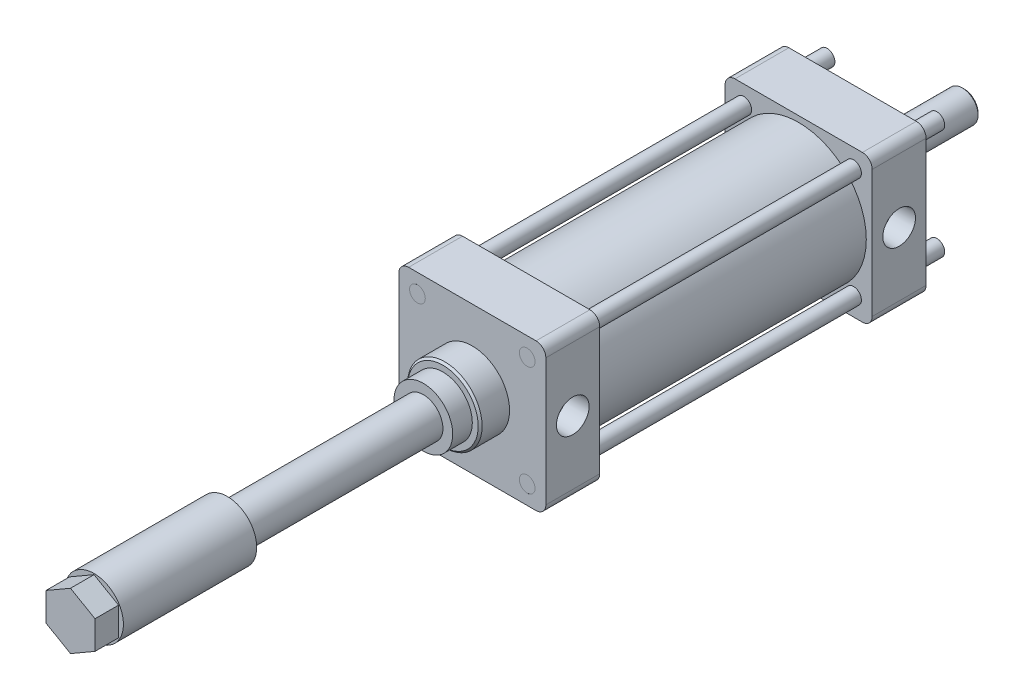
ISO-10303-21;
HEADER;
FILE_DESCRIPTION(('STEP AP214'),'2;1');
FILE_NAME('part.step','',(''),(''),'','','');
FILE_SCHEMA(('AUTOMOTIVE_DESIGN { 1 0 10303 214 1 1 1 1 }'));
ENDSEC;
DATA;
#1=APPLICATION_CONTEXT('core data for automotive mechanical design processes');
#2=APPLICATION_PROTOCOL_DEFINITION('international standard','automotive_design',2000,#1);
#3=PRODUCT_CONTEXT('',#1,'mechanical');
#4=PRODUCT('Part','Part','',(#3));
#5=PRODUCT_RELATED_PRODUCT_CATEGORY('part','',(#4));
#6=PRODUCT_DEFINITION_FORMATION('','',#4);
#7=PRODUCT_DEFINITION_CONTEXT('part definition',#1,'design');
#8=PRODUCT_DEFINITION('design','',#6,#7);
#9=PRODUCT_DEFINITION_SHAPE('','',#8);
#10=(LENGTH_UNIT() NAMED_UNIT(*) SI_UNIT(.MILLI.,.METRE.));
#11=(NAMED_UNIT(*) PLANE_ANGLE_UNIT() SI_UNIT($,.RADIAN.));
#12=(NAMED_UNIT(*) SI_UNIT($,.STERADIAN.) SOLID_ANGLE_UNIT());
#13=UNCERTAINTY_MEASURE_WITH_UNIT(LENGTH_MEASURE(1.E-05),#10,'distance_accuracy_value','');
#14=(GEOMETRIC_REPRESENTATION_CONTEXT(3) GLOBAL_UNCERTAINTY_ASSIGNED_CONTEXT((#13)) GLOBAL_UNIT_ASSIGNED_CONTEXT((#10,
#11,#12)) REPRESENTATION_CONTEXT('',''));
#15=CARTESIAN_POINT('',(0.,0.,0.));
#16=DIRECTION('',(0.,0.,1.));
#17=DIRECTION('',(1.,0.,0.));
#18=AXIS2_PLACEMENT_3D('',#15,#16,#17);
#19=CARTESIAN_POINT('',(-32.5,32.5,194.));
#20=DIRECTION('',(0.,0.,1.));
#21=DIRECTION('',(1.,0.,0.));
#22=AXIS2_PLACEMENT_3D('',#19,#20,#21);
#23=PLANE('',#22);
#24=CARTESIAN_POINT('',(28.,-28.,194.));
#25=DIRECTION('',(0.,0.,1.));
#26=DIRECTION('',(1.,0.,0.));
#27=AXIS2_PLACEMENT_3D('',#24,#25,#26);
#28=CIRCLE('',#27,4.);
#29=CARTESIAN_POINT('',(32.,-28.,194.));
#30=VERTEX_POINT('',#29);
#31=EDGE_CURVE('E11',#30,#30,#28,.F.);
#32=ORIENTED_EDGE('',*,*,#31,.F.);
#33=EDGE_LOOP('',(#32));
#34=FACE_BOUND('',#33,.T.);
#35=ADVANCED_FACE('F43',(#34),#23,.T.);
#36=CARTESIAN_POINT('',(28.,-28.,205.313708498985));
#37=DIRECTION('',(0.,0.,-1.));
#38=DIRECTION('',(-1.,0.,0.));
#39=AXIS2_PLACEMENT_3D('',#36,#37,#38);
#40=CYLINDRICAL_SURFACE('',#39,4.);
#41=ORIENTED_EDGE('',*,*,#31,.T.);
#42=EDGE_LOOP('',(#41));
#43=FACE_BOUND('',#42,.T.);
#44=CARTESIAN_POINT('',(28.,-28.,-15.));
#45=DIRECTION('',(0.,0.,-1.));
#46=DIRECTION('',(-1.,0.,0.));
#47=AXIS2_PLACEMENT_3D('',#44,#45,#46);
#48=CIRCLE('',#47,4.);
#49=CARTESIAN_POINT('',(24.,-28.,-15.));
#50=VERTEX_POINT('',#49);
#51=EDGE_CURVE('E49',#50,#50,#48,.T.);
#52=ORIENTED_EDGE('',*,*,#51,.F.);
#53=EDGE_LOOP('',(#52));
#54=FACE_BOUND('',#53,.T.);
#55=ADVANCED_FACE('F57',(#43,#54),#40,.T.);
#56=CARTESIAN_POINT('',(28.,-28.,-15.));
#57=DIRECTION('',(0.,0.,-1.));
#58=DIRECTION('',(-1.,0.,0.));
#59=AXIS2_PLACEMENT_3D('',#56,#57,#58);
#60=PLANE('',#59);
#61=ORIENTED_EDGE('',*,*,#51,.T.);
#62=EDGE_LOOP('',(#61));
#63=FACE_BOUND('',#62,.T.);
#64=ADVANCED_FACE('F55',(#63),#60,.T.);
#65=CLOSED_SHELL('',(#35,#55,#64));
#66=MANIFOLD_SOLID_BREP('B2',#65);
#67=CARTESIAN_POINT('',(-32.5,32.5,194.));
#68=DIRECTION('',(0.,0.,1.));
#69=DIRECTION('',(1.,0.,0.));
#70=AXIS2_PLACEMENT_3D('',#67,#68,#69);
#71=PLANE('',#70);
#72=CARTESIAN_POINT('',(-28.0000000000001,-27.9999999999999,194.));
#73=DIRECTION('',(0.,0.,1.));
#74=DIRECTION('',(1.,0.,0.));
#75=AXIS2_PLACEMENT_3D('',#72,#73,#74);
#76=CIRCLE('',#75,4.);
#77=CARTESIAN_POINT('',(-24.0000000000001,-27.9999999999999,194.));
#78=VERTEX_POINT('',#77);
#79=EDGE_CURVE('E42',#78,#78,#76,.F.);
#80=ORIENTED_EDGE('',*,*,#79,.F.);
#81=EDGE_LOOP('',(#80));
#82=FACE_BOUND('',#81,.T.);
#83=ADVANCED_FACE('F91',(#82),#71,.T.);
#84=CARTESIAN_POINT('',(-28.0000000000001,-27.9999999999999,205.313708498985));
#85=DIRECTION('',(0.,0.,-1.));
#86=DIRECTION('',(-1.,0.,0.));
#87=AXIS2_PLACEMENT_3D('',#84,#85,#86);
#88=CYLINDRICAL_SURFACE('',#87,4.);
#89=ORIENTED_EDGE('',*,*,#79,.T.);
#90=EDGE_LOOP('',(#89));
#91=FACE_BOUND('',#90,.T.);
#92=CARTESIAN_POINT('',(-28.0000000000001,-27.9999999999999,-15.));
#93=DIRECTION('',(0.,0.,-1.));
#94=DIRECTION('',(-1.,0.,0.));
#95=AXIS2_PLACEMENT_3D('',#92,#93,#94);
#96=CIRCLE('',#95,4.);
#97=CARTESIAN_POINT('',(-32.0000000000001,-27.9999999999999,-15.));
#98=VERTEX_POINT('',#97);
#99=EDGE_CURVE('E97',#98,#98,#96,.T.);
#100=ORIENTED_EDGE('',*,*,#99,.F.);
#101=EDGE_LOOP('',(#100));
#102=FACE_BOUND('',#101,.T.);
#103=ADVANCED_FACE('F105',(#91,#102),#88,.T.);
#104=CARTESIAN_POINT('',(-28.0000000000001,-27.9999999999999,-15.));
#105=DIRECTION('',(0.,0.,-1.));
#106=DIRECTION('',(-1.,0.,0.));
#107=AXIS2_PLACEMENT_3D('',#104,#105,#106);
#108=PLANE('',#107);
#109=ORIENTED_EDGE('',*,*,#99,.T.);
#110=EDGE_LOOP('',(#109));
#111=FACE_BOUND('',#110,.T.);
#112=ADVANCED_FACE('F103',(#111),#108,.T.);
#113=CLOSED_SHELL('',(#83,#103,#112));
#114=MANIFOLD_SOLID_BREP('B6',#113);
#115=CARTESIAN_POINT('',(-32.5,32.5,194.));
#116=DIRECTION('',(0.,0.,1.));
#117=DIRECTION('',(1.,0.,0.));
#118=AXIS2_PLACEMENT_3D('',#115,#116,#117);
#119=PLANE('',#118);
#120=CARTESIAN_POINT('',(-27.9999999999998,28.0000000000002,194.));
#121=DIRECTION('',(0.,0.,1.));
#122=DIRECTION('',(1.,0.,0.));
#123=AXIS2_PLACEMENT_3D('',#120,#121,#122);
#124=CIRCLE('',#123,4.);
#125=CARTESIAN_POINT('',(-23.9999999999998,28.0000000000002,194.));
#126=VERTEX_POINT('',#125);
#127=EDGE_CURVE('E90',#126,#126,#124,.F.);
#128=ORIENTED_EDGE('',*,*,#127,.F.);
#129=EDGE_LOOP('',(#128));
#130=FACE_BOUND('',#129,.T.);
#131=ADVANCED_FACE('F139',(#130),#119,.T.);
#132=CARTESIAN_POINT('',(-27.9999999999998,28.0000000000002,205.313708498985));
#133=DIRECTION('',(0.,0.,-1.));
#134=DIRECTION('',(-1.,0.,0.));
#135=AXIS2_PLACEMENT_3D('',#132,#133,#134);
#136=CYLINDRICAL_SURFACE('',#135,4.);
#137=ORIENTED_EDGE('',*,*,#127,.T.);
#138=EDGE_LOOP('',(#137));
#139=FACE_BOUND('',#138,.T.);
#140=CARTESIAN_POINT('',(-27.9999999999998,28.0000000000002,-15.));
#141=DIRECTION('',(0.,0.,-1.));
#142=DIRECTION('',(-1.,0.,0.));
#143=AXIS2_PLACEMENT_3D('',#140,#141,#142);
#144=CIRCLE('',#143,4.);
#145=CARTESIAN_POINT('',(-31.9999999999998,28.0000000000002,-15.));
#146=VERTEX_POINT('',#145);
#147=EDGE_CURVE('E145',#146,#146,#144,.T.);
#148=ORIENTED_EDGE('',*,*,#147,.F.);
#149=EDGE_LOOP('',(#148));
#150=FACE_BOUND('',#149,.T.);
#151=ADVANCED_FACE('F153',(#139,#150),#136,.T.);
#152=CARTESIAN_POINT('',(-27.9999999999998,28.0000000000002,-15.));
#153=DIRECTION('',(0.,0.,-1.));
#154=DIRECTION('',(-1.,0.,0.));
#155=AXIS2_PLACEMENT_3D('',#152,#153,#154);
#156=PLANE('',#155);
#157=ORIENTED_EDGE('',*,*,#147,.T.);
#158=EDGE_LOOP('',(#157));
#159=FACE_BOUND('',#158,.T.);
#160=ADVANCED_FACE('F151',(#159),#156,.T.);
#161=CLOSED_SHELL('',(#131,#151,#160));
#162=MANIFOLD_SOLID_BREP('B37',#161);
#163=CARTESIAN_POINT('',(-32.5,32.5,194.));
#164=DIRECTION('',(0.,0.,1.));
#165=DIRECTION('',(1.,0.,0.));
#166=AXIS2_PLACEMENT_3D('',#163,#164,#165);
#167=PLANE('',#166);
#168=CARTESIAN_POINT('',(28.0000000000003,27.9999999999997,194.));
#169=DIRECTION('',(0.,0.,1.));
#170=DIRECTION('',(1.,0.,0.));
#171=AXIS2_PLACEMENT_3D('',#168,#169,#170);
#172=CIRCLE('',#171,4.);
#173=CARTESIAN_POINT('',(32.0000000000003,27.9999999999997,194.));
#174=VERTEX_POINT('',#173);
#175=EDGE_CURVE('E138',#174,#174,#172,.F.);
#176=ORIENTED_EDGE('',*,*,#175,.F.);
#177=EDGE_LOOP('',(#176));
#178=FACE_BOUND('',#177,.T.);
#179=ADVANCED_FACE('F188',(#178),#167,.T.);
#180=CARTESIAN_POINT('',(28.0000000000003,27.9999999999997,205.313708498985));
#181=DIRECTION('',(0.,0.,-1.));
#182=DIRECTION('',(-1.,0.,0.));
#183=AXIS2_PLACEMENT_3D('',#180,#181,#182);
#184=CYLINDRICAL_SURFACE('',#183,4.);
#185=ORIENTED_EDGE('',*,*,#175,.T.);
#186=EDGE_LOOP('',(#185));
#187=FACE_BOUND('',#186,.T.);
#188=CARTESIAN_POINT('',(28.0000000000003,27.9999999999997,-15.));
#189=DIRECTION('',(0.,0.,-1.));
#190=DIRECTION('',(-1.,0.,0.));
#191=AXIS2_PLACEMENT_3D('',#188,#189,#190);
#192=CIRCLE('',#191,4.);
#193=CARTESIAN_POINT('',(24.0000000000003,27.9999999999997,-15.));
#194=VERTEX_POINT('',#193);
#195=EDGE_CURVE('E194',#194,#194,#192,.T.);
#196=ORIENTED_EDGE('',*,*,#195,.F.);
#197=EDGE_LOOP('',(#196));
#198=FACE_BOUND('',#197,.T.);
#199=ADVANCED_FACE('F202',(#187,#198),#184,.T.);
#200=CARTESIAN_POINT('',(28.0000000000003,27.9999999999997,-15.));
#201=DIRECTION('',(0.,0.,-1.));
#202=DIRECTION('',(-1.,0.,0.));
#203=AXIS2_PLACEMENT_3D('',#200,#201,#202);
#204=PLANE('',#203);
#205=ORIENTED_EDGE('',*,*,#195,.T.);
#206=EDGE_LOOP('',(#205));
#207=FACE_BOUND('',#206,.T.);
#208=ADVANCED_FACE('F200',(#207),#204,.T.);
#209=CLOSED_SHELL('',(#179,#199,#208));
#210=MANIFOLD_SOLID_BREP('B85',#209);
#211=CARTESIAN_POINT('',(0.,0.,387.));
#212=DIRECTION('',(0.,0.,1.));
#213=DIRECTION('',(1.,0.,0.));
#214=AXIS2_PLACEMENT_3D('',#211,#212,#213);
#215=PLANE('',#214);
#216=CARTESIAN_POINT('',(0.,0.,387.));
#217=DIRECTION('',(0.,0.,1.));
#218=DIRECTION('',(1.,0.,0.));
#219=AXIS2_PLACEMENT_3D('',#216,#217,#218);
#220=CIRCLE('',#219,15.);
#221=CARTESIAN_POINT('',(15.,0.,387.));
#222=VERTEX_POINT('',#221);
#223=EDGE_CURVE('E773',#222,#222,#220,.T.);
#224=ORIENTED_EDGE('',*,*,#223,.T.);
#225=EDGE_LOOP('',(#224));
#226=FACE_BOUND('',#225,.T.);
#227=DIRECTION('',(0.866025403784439,0.5,0.));
#228=VECTOR('',#227,1.);
#229=CARTESIAN_POINT('',(0.,-14.4337567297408,387.));
#230=LINE('',#229,#228);
#231=CARTESIAN_POINT('',(0.,-14.4337567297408,387.));
#232=VERTEX_POINT('',#231);
#233=CARTESIAN_POINT('',(12.5000000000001,-7.21687836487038,387.));
#234=VERTEX_POINT('',#233);
#235=EDGE_CURVE('E808',#232,#234,#230,.T.);
#236=ORIENTED_EDGE('',*,*,#235,.F.);
#237=DIRECTION('',(0.866025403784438,-0.5,0.));
#238=VECTOR('',#237,1.);
#239=CARTESIAN_POINT('',(-12.5000000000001,-7.21687836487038,387.));
#240=LINE('',#239,#238);
#241=CARTESIAN_POINT('',(-12.5000000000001,-7.21687836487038,387.));
#242=VERTEX_POINT('',#241);
#243=EDGE_CURVE('E811',#242,#232,#240,.T.);
#244=ORIENTED_EDGE('',*,*,#243,.F.);
#245=DIRECTION('',(0.,-1.,0.));
#246=VECTOR('',#245,1.);
#247=CARTESIAN_POINT('',(-12.5000000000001,7.21687836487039,387.));
#248=LINE('',#247,#246);
#249=CARTESIAN_POINT('',(-12.5000000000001,7.21687836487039,387.));
#250=VERTEX_POINT('',#249);
#251=EDGE_CURVE('E797',#250,#242,#248,.T.);
#252=ORIENTED_EDGE('',*,*,#251,.F.);
#253=DIRECTION('',(-0.866025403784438,-0.5,0.));
#254=VECTOR('',#253,1.);
#255=CARTESIAN_POINT('',(0.,14.4337567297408,387.));
#256=LINE('',#255,#254);
#257=CARTESIAN_POINT('',(0.,14.4337567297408,387.));
#258=VERTEX_POINT('',#257);
#259=EDGE_CURVE('E800',#258,#250,#256,.T.);
#260=ORIENTED_EDGE('',*,*,#259,.F.);
#261=DIRECTION('',(-0.866025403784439,0.5,0.));
#262=VECTOR('',#261,1.);
#263=CARTESIAN_POINT('',(12.5000000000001,7.21687836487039,387.));
#264=LINE('',#263,#262);
#265=CARTESIAN_POINT('',(12.5000000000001,7.21687836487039,387.));
#266=VERTEX_POINT('',#265);
#267=EDGE_CURVE('E802',#266,#258,#264,.T.);
#268=ORIENTED_EDGE('',*,*,#267,.F.);
#269=DIRECTION('',(0.,1.,0.));
#270=VECTOR('',#269,1.);
#271=CARTESIAN_POINT('',(12.5000000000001,-7.21687836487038,387.));
#272=LINE('',#271,#270);
#273=EDGE_CURVE('E805',#234,#266,#272,.T.);
#274=ORIENTED_EDGE('',*,*,#273,.F.);
#275=EDGE_LOOP('',(#236,#244,#252,#260,#268,#274));
#276=FACE_BOUND('',#275,.T.);
#277=ADVANCED_FACE('F229',(#226,#276),#215,.T.);
#278=CARTESIAN_POINT('',(-32.5,-32.5,27.5));
#279=DIRECTION('',(0.,0.,1.));
#280=DIRECTION('',(1.,0.,0.));
#281=AXIS2_PLACEMENT_3D('',#278,#279,#280);
#282=PLANE('',#281);
#283=CARTESIAN_POINT('',(0.,0.,27.5));
#284=DIRECTION('',(0.,0.,1.));
#285=DIRECTION('',(1.,0.,0.));
#286=AXIS2_PLACEMENT_3D('',#283,#284,#285);
#287=CIRCLE('',#286,34.5);
#288=CARTESIAN_POINT('',(34.5,0.,27.5));
#289=VERTEX_POINT('',#288);
#290=EDGE_CURVE('E600',#289,#289,#287,.T.);
#291=ORIENTED_EDGE('',*,*,#290,.F.);
#292=EDGE_LOOP('',(#291));
#293=FACE_BOUND('',#292,.T.);
#294=CARTESIAN_POINT('',(-27.9999999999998,28.0000000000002,27.5));
#295=DIRECTION('',(0.,0.,1.));
#296=DIRECTION('',(1.,0.,0.));
#297=AXIS2_PLACEMENT_3D('',#294,#295,#296);
#298=CIRCLE('',#297,4.);
#299=CARTESIAN_POINT('',(-23.9999999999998,28.0000000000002,27.5));
#300=VERTEX_POINT('',#299);
#301=EDGE_CURVE('E610',#300,#300,#298,.T.);
#302=ORIENTED_EDGE('',*,*,#301,.F.);
#303=EDGE_LOOP('',(#302));
#304=FACE_BOUND('',#303,.T.);
#305=CARTESIAN_POINT('',(28.,-28.,27.5));
#306=DIRECTION('',(0.,0.,1.));
#307=DIRECTION('',(1.,0.,0.));
#308=AXIS2_PLACEMENT_3D('',#305,#306,#307);
#309=CIRCLE('',#308,4.);
#310=CARTESIAN_POINT('',(32.,-28.,27.5));
#311=VERTEX_POINT('',#310);
#312=EDGE_CURVE('E344',#311,#311,#309,.T.);
#313=ORIENTED_EDGE('',*,*,#312,.F.);
#314=EDGE_LOOP('',(#313));
#315=FACE_BOUND('',#314,.T.);
#316=CARTESIAN_POINT('',(-32.5,-32.5,27.5));
#317=DIRECTION('',(0.,0.,1.));
#318=DIRECTION('',(1.,0.,0.));
#319=AXIS2_PLACEMENT_3D('',#316,#317,#318);
#320=CIRCLE('',#319,5.);
#321=CARTESIAN_POINT('',(-37.5,-32.5,27.5));
#322=VERTEX_POINT('',#321);
#323=CARTESIAN_POINT('',(-32.4999999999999,-37.5,27.5));
#324=VERTEX_POINT('',#323);
#325=EDGE_CURVE('E356',#322,#324,#320,.T.);
#326=ORIENTED_EDGE('',*,*,#325,.T.);
#327=DIRECTION('',(1.,0.,0.));
#328=VECTOR('',#327,1.);
#329=CARTESIAN_POINT('',(32.5,-37.5,27.5));
#330=LINE('',#329,#328);
#331=CARTESIAN_POINT('',(32.5,-37.5,27.5));
#332=VERTEX_POINT('',#331);
#333=EDGE_CURVE('E295',#324,#332,#330,.T.);
#334=ORIENTED_EDGE('',*,*,#333,.T.);
#335=CARTESIAN_POINT('',(32.5,-32.5,27.5));
#336=DIRECTION('',(0.,0.,1.));
#337=DIRECTION('',(-1.,0.,0.));
#338=AXIS2_PLACEMENT_3D('',#335,#336,#337);
#339=CIRCLE('',#338,5.);
#340=CARTESIAN_POINT('',(37.5,-32.5,27.5));
#341=VERTEX_POINT('',#340);
#342=EDGE_CURVE('E628',#332,#341,#339,.T.);
#343=ORIENTED_EDGE('',*,*,#342,.T.);
#344=DIRECTION('',(0.,1.,0.));
#345=VECTOR('',#344,1.);
#346=CARTESIAN_POINT('',(37.5,32.5,27.5));
#347=LINE('',#346,#345);
#348=CARTESIAN_POINT('',(37.5,32.5,27.5));
#349=VERTEX_POINT('',#348);
#350=EDGE_CURVE('E630',#341,#349,#347,.T.);
#351=ORIENTED_EDGE('',*,*,#350,.T.);
#352=CARTESIAN_POINT('',(32.5,32.5,27.5));
#353=DIRECTION('',(0.,0.,1.));
#354=DIRECTION('',(-1.,0.,0.));
#355=AXIS2_PLACEMENT_3D('',#352,#353,#354);
#356=CIRCLE('',#355,5.);
#357=CARTESIAN_POINT('',(32.5,37.5,27.5));
#358=VERTEX_POINT('',#357);
#359=EDGE_CURVE('E319',#349,#358,#356,.T.);
#360=ORIENTED_EDGE('',*,*,#359,.T.);
#361=DIRECTION('',(-1.,0.,0.));
#362=VECTOR('',#361,1.);
#363=CARTESIAN_POINT('',(32.5,37.5,27.5));
#364=LINE('',#363,#362);
#365=CARTESIAN_POINT('',(-32.4999999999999,37.5,27.5));
#366=VERTEX_POINT('',#365);
#367=EDGE_CURVE('E311',#358,#366,#364,.T.);
#368=ORIENTED_EDGE('',*,*,#367,.T.);
#369=CARTESIAN_POINT('',(-32.5,32.5,27.5));
#370=DIRECTION('',(0.,0.,1.));
#371=DIRECTION('',(-1.,0.,0.));
#372=AXIS2_PLACEMENT_3D('',#369,#370,#371);
#373=CIRCLE('',#372,5.);
#374=CARTESIAN_POINT('',(-37.5,32.5,27.5));
#375=VERTEX_POINT('',#374);
#376=EDGE_CURVE('E316',#366,#375,#373,.T.);
#377=ORIENTED_EDGE('',*,*,#376,.T.);
#378=DIRECTION('',(0.,-1.,0.));
#379=VECTOR('',#378,1.);
#380=CARTESIAN_POINT('',(-37.5,32.5,27.5));
#381=LINE('',#380,#379);
#382=EDGE_CURVE('E253',#375,#322,#381,.T.);
#383=ORIENTED_EDGE('',*,*,#382,.T.);
#384=EDGE_LOOP('',(#326,#334,#343,#351,#360,#368,#377,#383));
#385=FACE_BOUND('',#384,.T.);
#386=CARTESIAN_POINT('',(-28.0000000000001,-27.9999999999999,27.5));
#387=DIRECTION('',(0.,0.,1.));
#388=DIRECTION('',(1.,0.,0.));
#389=AXIS2_PLACEMENT_3D('',#386,#387,#388);
#390=CIRCLE('',#389,4.);
#391=CARTESIAN_POINT('',(-24.0000000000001,-27.9999999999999,27.5));
#392=VERTEX_POINT('',#391);
#393=EDGE_CURVE('E616',#392,#392,#390,.T.);
#394=ORIENTED_EDGE('',*,*,#393,.F.);
#395=EDGE_LOOP('',(#394));
#396=FACE_BOUND('',#395,.T.);
#397=CARTESIAN_POINT('',(28.0000000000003,27.9999999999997,27.5));
#398=DIRECTION('',(0.,0.,1.));
#399=DIRECTION('',(1.,0.,0.));
#400=AXIS2_PLACEMENT_3D('',#397,#398,#399);
#401=CIRCLE('',#400,4.);
#402=CARTESIAN_POINT('',(32.0000000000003,27.9999999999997,27.5));
#403=VERTEX_POINT('',#402);
#404=EDGE_CURVE('E604',#403,#403,#401,.T.);
#405=ORIENTED_EDGE('',*,*,#404,.F.);
#406=EDGE_LOOP('',(#405));
#407=FACE_BOUND('',#406,.T.);
#408=ADVANCED_FACE('F313',(#293,#304,#315,#385,#396,#407),#282,.T.);
#409=CARTESIAN_POINT('',(-32.5,-32.5,0.));
#410=DIRECTION('',(0.,0.,1.));
#411=DIRECTION('',(1.,0.,0.));
#412=AXIS2_PLACEMENT_3D('',#409,#410,#411);
#413=PLANE('',#412);
#414=CARTESIAN_POINT('',(0.,0.,0.));
#415=DIRECTION('',(0.,0.,1.));
#416=DIRECTION('',(1.,0.,0.));
#417=AXIS2_PLACEMENT_3D('',#414,#415,#416);
#418=CIRCLE('',#417,19.);
#419=CARTESIAN_POINT('',(19.,0.,0.));
#420=VERTEX_POINT('',#419);
#421=EDGE_CURVE('E371',#420,#420,#418,.F.);
#422=ORIENTED_EDGE('',*,*,#421,.F.);
#423=EDGE_LOOP('',(#422));
#424=FACE_BOUND('',#423,.T.);
#425=CARTESIAN_POINT('',(-32.5,-32.5,0.));
#426=DIRECTION('',(0.,0.,1.));
#427=DIRECTION('',(1.,0.,0.));
#428=AXIS2_PLACEMENT_3D('',#425,#426,#427);
#429=CIRCLE('',#428,5.);
#430=CARTESIAN_POINT('',(-37.5,-32.5,0.));
#431=VERTEX_POINT('',#430);
#432=CARTESIAN_POINT('',(-32.4999999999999,-37.5,0.));
#433=VERTEX_POINT('',#432);
#434=EDGE_CURVE('E340',#431,#433,#429,.T.);
#435=ORIENTED_EDGE('',*,*,#434,.F.);
#436=DIRECTION('',(0.,-1.,0.));
#437=VECTOR('',#436,1.);
#438=CARTESIAN_POINT('',(-37.5,32.5,0.));
#439=LINE('',#438,#437);
#440=CARTESIAN_POINT('',(-37.5,32.5,0.));
#441=VERTEX_POINT('',#440);
#442=EDGE_CURVE('E286',#441,#431,#439,.T.);
#443=ORIENTED_EDGE('',*,*,#442,.F.);
#444=CARTESIAN_POINT('',(-32.5,32.5,0.));
#445=DIRECTION('',(0.,0.,1.));
#446=DIRECTION('',(-1.,0.,0.));
#447=AXIS2_PLACEMENT_3D('',#444,#445,#446);
#448=CIRCLE('',#447,5.);
#449=CARTESIAN_POINT('',(-32.4999999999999,37.5,0.));
#450=VERTEX_POINT('',#449);
#451=EDGE_CURVE('E353',#450,#441,#448,.T.);
#452=ORIENTED_EDGE('',*,*,#451,.F.);
#453=DIRECTION('',(-1.,0.,0.));
#454=VECTOR('',#453,1.);
#455=CARTESIAN_POINT('',(32.5,37.5,0.));
#456=LINE('',#455,#454);
#457=CARTESIAN_POINT('',(32.5,37.5,0.));
#458=VERTEX_POINT('',#457);
#459=EDGE_CURVE('E328',#458,#450,#456,.T.);
#460=ORIENTED_EDGE('',*,*,#459,.F.);
#461=CARTESIAN_POINT('',(32.5,32.5,0.));
#462=DIRECTION('',(0.,0.,1.));
#463=DIRECTION('',(-1.,0.,0.));
#464=AXIS2_PLACEMENT_3D('',#461,#462,#463);
#465=CIRCLE('',#464,5.);
#466=CARTESIAN_POINT('',(37.5,32.5,0.));
#467=VERTEX_POINT('',#466);
#468=EDGE_CURVE('E350',#467,#458,#465,.T.);
#469=ORIENTED_EDGE('',*,*,#468,.F.);
#470=DIRECTION('',(0.,1.,0.));
#471=VECTOR('',#470,1.);
#472=CARTESIAN_POINT('',(37.5,32.5,0.));
#473=LINE('',#472,#471);
#474=CARTESIAN_POINT('',(37.5,-32.5,0.));
#475=VERTEX_POINT('',#474);
#476=EDGE_CURVE('E348',#475,#467,#473,.T.);
#477=ORIENTED_EDGE('',*,*,#476,.F.);
#478=CARTESIAN_POINT('',(32.5,-32.5,0.));
#479=DIRECTION('',(0.,0.,1.));
#480=DIRECTION('',(-1.,0.,0.));
#481=AXIS2_PLACEMENT_3D('',#478,#479,#480);
#482=CIRCLE('',#481,5.);
#483=CARTESIAN_POINT('',(32.5,-37.5,0.));
#484=VERTEX_POINT('',#483);
#485=EDGE_CURVE('E346',#484,#475,#482,.T.);
#486=ORIENTED_EDGE('',*,*,#485,.F.);
#487=DIRECTION('',(1.,0.,0.));
#488=VECTOR('',#487,1.);
#489=CARTESIAN_POINT('',(32.5,-37.5,0.));
#490=LINE('',#489,#488);
#491=EDGE_CURVE('E343',#433,#484,#490,.T.);
#492=ORIENTED_EDGE('',*,*,#491,.F.);
#493=EDGE_LOOP('',(#435,#443,#452,#460,#469,#477,#486,#492));
#494=FACE_BOUND('',#493,.T.);
#495=CARTESIAN_POINT('',(28.,-28.,0.));
#496=DIRECTION('',(0.,0.,1.));
#497=DIRECTION('',(1.,0.,0.));
#498=AXIS2_PLACEMENT_3D('',#495,#496,#497);
#499=CIRCLE('',#498,4.);
#500=CARTESIAN_POINT('',(32.,-28.,0.));
#501=VERTEX_POINT('',#500);
#502=EDGE_CURVE('E619',#501,#501,#499,.T.);
#503=ORIENTED_EDGE('',*,*,#502,.T.);
#504=EDGE_LOOP('',(#503));
#505=FACE_BOUND('',#504,.T.);
#506=CARTESIAN_POINT('',(-28.0000000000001,-27.9999999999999,0.));
#507=DIRECTION('',(0.,0.,1.));
#508=DIRECTION('',(1.,0.,0.));
#509=AXIS2_PLACEMENT_3D('',#506,#507,#508);
#510=CIRCLE('',#509,4.);
#511=CARTESIAN_POINT('',(-24.0000000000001,-27.9999999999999,0.));
#512=VERTEX_POINT('',#511);
#513=EDGE_CURVE('E613',#512,#512,#510,.T.);
#514=ORIENTED_EDGE('',*,*,#513,.T.);
#515=EDGE_LOOP('',(#514));
#516=FACE_BOUND('',#515,.T.);
#517=CARTESIAN_POINT('',(-27.9999999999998,28.0000000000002,0.));
#518=DIRECTION('',(0.,0.,1.));
#519=DIRECTION('',(1.,0.,0.));
#520=AXIS2_PLACEMENT_3D('',#517,#518,#519);
#521=CIRCLE('',#520,4.);
#522=CARTESIAN_POINT('',(-23.9999999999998,28.0000000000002,0.));
#523=VERTEX_POINT('',#522);
#524=EDGE_CURVE('E607',#523,#523,#521,.T.);
#525=ORIENTED_EDGE('',*,*,#524,.T.);
#526=EDGE_LOOP('',(#525));
#527=FACE_BOUND('',#526,.T.);
#528=CARTESIAN_POINT('',(28.0000000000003,27.9999999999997,0.));
#529=DIRECTION('',(0.,0.,1.));
#530=DIRECTION('',(1.,0.,0.));
#531=AXIS2_PLACEMENT_3D('',#528,#529,#530);
#532=CIRCLE('',#531,4.);
#533=CARTESIAN_POINT('',(32.0000000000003,27.9999999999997,0.));
#534=VERTEX_POINT('',#533);
#535=EDGE_CURVE('E597',#534,#534,#532,.T.);
#536=ORIENTED_EDGE('',*,*,#535,.T.);
#537=EDGE_LOOP('',(#536));
#538=FACE_BOUND('',#537,.T.);
#539=ADVANCED_FACE('F417',(#424,#494,#505,#516,#527,#538),#413,.F.);
#540=CARTESIAN_POINT('',(-32.5,-32.5,27.5));
#541=DIRECTION('',(0.,0.,-1.));
#542=DIRECTION('',(-1.,0.,0.));
#543=AXIS2_PLACEMENT_3D('',#540,#541,#542);
#544=CYLINDRICAL_SURFACE('',#543,5.);
#545=ORIENTED_EDGE('',*,*,#434,.T.);
#546=DIRECTION('',(0.,0.,-1.));
#547=VECTOR('',#546,1.);
#548=CARTESIAN_POINT('',(-32.4999999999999,-37.5,27.5));
#549=LINE('',#548,#547);
#550=EDGE_CURVE('E369',#324,#433,#549,.T.);
#551=ORIENTED_EDGE('',*,*,#550,.F.);
#552=ORIENTED_EDGE('',*,*,#325,.F.);
#553=DIRECTION('',(0.,0.,-1.));
#554=VECTOR('',#553,1.);
#555=CARTESIAN_POINT('',(-37.5,-32.5,27.5));
#556=LINE('',#555,#554);
#557=EDGE_CURVE('E336',#322,#431,#556,.T.);
#558=ORIENTED_EDGE('',*,*,#557,.T.);
#559=EDGE_LOOP('',(#545,#551,#552,#558));
#560=FACE_BOUND('',#559,.T.);
#561=ADVANCED_FACE('F549',(#560),#544,.T.);
#562=CARTESIAN_POINT('',(32.5,-37.5,27.5));
#563=DIRECTION('',(0.,1.,0.));
#564=DIRECTION('',(0.,0.,1.));
#565=AXIS2_PLACEMENT_3D('',#562,#563,#564);
#566=PLANE('',#565);
#567=ORIENTED_EDGE('',*,*,#491,.T.);
#568=DIRECTION('',(0.,0.,-1.));
#569=VECTOR('',#568,1.);
#570=CARTESIAN_POINT('',(32.5,-37.5,27.5));
#571=LINE('',#570,#569);
#572=EDGE_CURVE('E366',#332,#484,#571,.T.);
#573=ORIENTED_EDGE('',*,*,#572,.F.);
#574=ORIENTED_EDGE('',*,*,#333,.F.);
#575=ORIENTED_EDGE('',*,*,#550,.T.);
#576=EDGE_LOOP('',(#567,#573,#574,#575));
#577=FACE_BOUND('',#576,.T.);
#578=ADVANCED_FACE('F568',(#577),#566,.F.);
#579=CARTESIAN_POINT('',(32.5,-32.5,27.5));
#580=DIRECTION('',(0.,0.,-1.));
#581=DIRECTION('',(-1.,0.,0.));
#582=AXIS2_PLACEMENT_3D('',#579,#580,#581);
#583=CYLINDRICAL_SURFACE('',#582,5.);
#584=ORIENTED_EDGE('',*,*,#485,.T.);
#585=DIRECTION('',(0.,0.,-1.));
#586=VECTOR('',#585,1.);
#587=CARTESIAN_POINT('',(37.5,-32.5,27.5));
#588=LINE('',#587,#586);
#589=EDGE_CURVE('E363',#341,#475,#588,.T.);
#590=ORIENTED_EDGE('',*,*,#589,.F.);
#591=ORIENTED_EDGE('',*,*,#342,.F.);
#592=ORIENTED_EDGE('',*,*,#572,.T.);
#593=EDGE_LOOP('',(#584,#590,#591,#592));
#594=FACE_BOUND('',#593,.T.);
#595=ADVANCED_FACE('F564',(#594),#583,.T.);
#596=CARTESIAN_POINT('',(37.5,32.5,27.5));
#597=DIRECTION('',(-1.,0.,0.));
#598=DIRECTION('',(0.,-1.,0.));
#599=AXIS2_PLACEMENT_3D('',#596,#597,#598);
#600=PLANE('',#599);
#601=CARTESIAN_POINT('',(37.5,0.,13.75));
#602=DIRECTION('',(1.,0.,0.));
#603=DIRECTION('',(0.,0.,-1.));
#604=AXIS2_PLACEMENT_3D('',#601,#602,#603);
#605=CIRCLE('',#604,8.331);
#606=CARTESIAN_POINT('',(37.5,0.,5.419));
#607=VERTEX_POINT('',#606);
#608=EDGE_CURVE('E851',#607,#607,#605,.T.);
#609=ORIENTED_EDGE('',*,*,#608,.F.);
#610=EDGE_LOOP('',(#609));
#611=FACE_BOUND('',#610,.T.);
#612=ORIENTED_EDGE('',*,*,#476,.T.);
#613=DIRECTION('',(0.,0.,-1.));
#614=VECTOR('',#613,1.);
#615=CARTESIAN_POINT('',(37.5,32.5,27.5));
#616=LINE('',#615,#614);
#617=EDGE_CURVE('E360',#349,#467,#616,.T.);
#618=ORIENTED_EDGE('',*,*,#617,.F.);
#619=ORIENTED_EDGE('',*,*,#350,.F.);
#620=ORIENTED_EDGE('',*,*,#589,.T.);
#621=EDGE_LOOP('',(#612,#618,#619,#620));
#622=FACE_BOUND('',#621,.T.);
#623=ADVANCED_FACE('F560',(#611,#622),#600,.F.);
#624=CARTESIAN_POINT('',(32.5,32.5,27.5));
#625=DIRECTION('',(0.,0.,-1.));
#626=DIRECTION('',(-1.,0.,0.));
#627=AXIS2_PLACEMENT_3D('',#624,#625,#626);
#628=CYLINDRICAL_SURFACE('',#627,5.);
#629=ORIENTED_EDGE('',*,*,#468,.T.);
#630=DIRECTION('',(0.,0.,-1.));
#631=VECTOR('',#630,1.);
#632=CARTESIAN_POINT('',(32.5,37.5,27.5));
#633=LINE('',#632,#631);
#634=EDGE_CURVE('E331',#358,#458,#633,.T.);
#635=ORIENTED_EDGE('',*,*,#634,.F.);
#636=ORIENTED_EDGE('',*,*,#359,.F.);
#637=ORIENTED_EDGE('',*,*,#617,.T.);
#638=EDGE_LOOP('',(#629,#635,#636,#637));
#639=FACE_BOUND('',#638,.T.);
#640=ADVANCED_FACE('F557',(#639),#628,.T.);
#641=CARTESIAN_POINT('',(32.5,37.5,27.5));
#642=DIRECTION('',(0.,-1.,0.));
#643=DIRECTION('',(1.,0.,0.));
#644=AXIS2_PLACEMENT_3D('',#641,#642,#643);
#645=PLANE('',#644);
#646=ORIENTED_EDGE('',*,*,#459,.T.);
#647=DIRECTION('',(0.,0.,-1.));
#648=VECTOR('',#647,1.);
#649=CARTESIAN_POINT('',(-32.4999999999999,37.5,27.5));
#650=LINE('',#649,#648);
#651=EDGE_CURVE('E325',#366,#450,#650,.T.);
#652=ORIENTED_EDGE('',*,*,#651,.F.);
#653=ORIENTED_EDGE('',*,*,#367,.F.);
#654=ORIENTED_EDGE('',*,*,#634,.T.);
#655=EDGE_LOOP('',(#646,#652,#653,#654));
#656=FACE_BOUND('',#655,.T.);
#657=ADVANCED_FACE('F326',(#656),#645,.F.);
#658=CARTESIAN_POINT('',(-32.5,32.5,27.5));
#659=DIRECTION('',(0.,0.,-1.));
#660=DIRECTION('',(-1.,0.,0.));
#661=AXIS2_PLACEMENT_3D('',#658,#659,#660);
#662=CYLINDRICAL_SURFACE('',#661,5.);
#663=ORIENTED_EDGE('',*,*,#451,.T.);
#664=DIRECTION('',(0.,0.,-1.));
#665=VECTOR('',#664,1.);
#666=CARTESIAN_POINT('',(-37.5,32.5,27.5));
#667=LINE('',#666,#665);
#668=EDGE_CURVE('E332',#375,#441,#667,.T.);
#669=ORIENTED_EDGE('',*,*,#668,.F.);
#670=ORIENTED_EDGE('',*,*,#376,.F.);
#671=ORIENTED_EDGE('',*,*,#651,.T.);
#672=EDGE_LOOP('',(#663,#669,#670,#671));
#673=FACE_BOUND('',#672,.T.);
#674=ADVANCED_FACE('F334',(#673),#662,.T.);
#675=CARTESIAN_POINT('',(-37.5,32.5,27.5));
#676=DIRECTION('',(1.,0.,0.));
#677=DIRECTION('',(0.,1.,0.));
#678=AXIS2_PLACEMENT_3D('',#675,#676,#677);
#679=PLANE('',#678);
#680=ORIENTED_EDGE('',*,*,#442,.T.);
#681=ORIENTED_EDGE('',*,*,#557,.F.);
#682=ORIENTED_EDGE('',*,*,#382,.F.);
#683=ORIENTED_EDGE('',*,*,#668,.T.);
#684=EDGE_LOOP('',(#680,#681,#682,#683));
#685=FACE_BOUND('',#684,.T.);
#686=ADVANCED_FACE('F544',(#685),#679,.F.);
#687=CARTESIAN_POINT('',(28.,-28.,27.5));
#688=DIRECTION('',(0.,0.,-1.));
#689=DIRECTION('',(-1.,0.,0.));
#690=AXIS2_PLACEMENT_3D('',#687,#688,#689);
#691=CYLINDRICAL_SURFACE('',#690,4.);
#692=ORIENTED_EDGE('',*,*,#312,.T.);
#693=EDGE_LOOP('',(#692));
#694=FACE_BOUND('',#693,.T.);
#695=ORIENTED_EDGE('',*,*,#502,.F.);
#696=EDGE_LOOP('',(#695));
#697=FACE_BOUND('',#696,.T.);
#698=ADVANCED_FACE('F541',(#694,#697),#691,.F.);
#699=CARTESIAN_POINT('',(-28.0000000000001,-27.9999999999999,27.5));
#700=DIRECTION('',(0.,0.,-1.));
#701=DIRECTION('',(-1.,0.,0.));
#702=AXIS2_PLACEMENT_3D('',#699,#700,#701);
#703=CYLINDRICAL_SURFACE('',#702,4.);
#704=ORIENTED_EDGE('',*,*,#393,.T.);
#705=EDGE_LOOP('',(#704));
#706=FACE_BOUND('',#705,.T.);
#707=ORIENTED_EDGE('',*,*,#513,.F.);
#708=EDGE_LOOP('',(#707));
#709=FACE_BOUND('',#708,.T.);
#710=ADVANCED_FACE('F537',(#706,#709),#703,.F.);
#711=CARTESIAN_POINT('',(-27.9999999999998,28.0000000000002,27.5));
#712=DIRECTION('',(0.,0.,-1.));
#713=DIRECTION('',(-1.,0.,0.));
#714=AXIS2_PLACEMENT_3D('',#711,#712,#713);
#715=CYLINDRICAL_SURFACE('',#714,4.);
#716=ORIENTED_EDGE('',*,*,#301,.T.);
#717=EDGE_LOOP('',(#716));
#718=FACE_BOUND('',#717,.T.);
#719=ORIENTED_EDGE('',*,*,#524,.F.);
#720=EDGE_LOOP('',(#719));
#721=FACE_BOUND('',#720,.T.);
#722=ADVANCED_FACE('F533',(#718,#721),#715,.F.);
#723=CARTESIAN_POINT('',(28.0000000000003,27.9999999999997,27.5));
#724=DIRECTION('',(0.,0.,-1.));
#725=DIRECTION('',(-1.,0.,0.));
#726=AXIS2_PLACEMENT_3D('',#723,#724,#725);
#727=CYLINDRICAL_SURFACE('',#726,4.);
#728=ORIENTED_EDGE('',*,*,#404,.T.);
#729=EDGE_LOOP('',(#728));
#730=FACE_BOUND('',#729,.T.);
#731=ORIENTED_EDGE('',*,*,#535,.F.);
#732=EDGE_LOOP('',(#731));
#733=FACE_BOUND('',#732,.T.);
#734=ADVANCED_FACE('F529',(#730,#733),#727,.F.);
#735=CARTESIAN_POINT('',(0.,0.,-15.));
#736=DIRECTION('',(0.,0.,1.));
#737=DIRECTION('',(1.,0.,0.));
#738=AXIS2_PLACEMENT_3D('',#735,#736,#737);
#739=CYLINDRICAL_SURFACE('',#738,19.);
#740=CARTESIAN_POINT('',(0.,0.,-14.));
#741=DIRECTION('',(0.,0.,-1.));
#742=DIRECTION('',(-1.,0.,0.));
#743=AXIS2_PLACEMENT_3D('',#740,#741,#742);
#744=CIRCLE('',#743,19.);
#745=CARTESIAN_POINT('',(-19.,0.,-14.));
#746=VERTEX_POINT('',#745);
#747=EDGE_CURVE('E383',#746,#746,#744,.F.);
#748=ORIENTED_EDGE('',*,*,#747,.T.);
#749=EDGE_LOOP('',(#748));
#750=FACE_BOUND('',#749,.T.);
#751=ORIENTED_EDGE('',*,*,#421,.T.);
#752=EDGE_LOOP('',(#751));
#753=FACE_BOUND('',#752,.T.);
#754=ADVANCED_FACE('F525',(#750,#753),#739,.T.);
#755=CARTESIAN_POINT('',(0.,0.,-15.));
#756=DIRECTION('',(0.,0.,-1.));
#757=DIRECTION('',(-1.,0.,0.));
#758=AXIS2_PLACEMENT_3D('',#755,#756,#757);
#759=PLANE('',#758);
#760=CARTESIAN_POINT('',(0.,0.,-15.));
#761=DIRECTION('',(0.,0.,-1.));
#762=DIRECTION('',(-1.,0.,0.));
#763=AXIS2_PLACEMENT_3D('',#760,#761,#762);
#764=CIRCLE('',#763,18.);
#765=CARTESIAN_POINT('',(-18.,0.,-15.));
#766=VERTEX_POINT('',#765);
#767=EDGE_CURVE('E380',#766,#766,#764,.T.);
#768=ORIENTED_EDGE('',*,*,#767,.T.);
#769=EDGE_LOOP('',(#768));
#770=FACE_BOUND('',#769,.T.);
#771=CARTESIAN_POINT('',(0.,0.,-15.));
#772=DIRECTION('',(0.,0.,-1.));
#773=DIRECTION('',(-1.,0.,0.));
#774=AXIS2_PLACEMENT_3D('',#771,#772,#773);
#775=CIRCLE('',#774,10.);
#776=CARTESIAN_POINT('',(-10.,0.,-15.));
#777=VERTEX_POINT('',#776);
#778=EDGE_CURVE('E593',#777,#777,#775,.T.);
#779=ORIENTED_EDGE('',*,*,#778,.F.);
#780=EDGE_LOOP('',(#779));
#781=FACE_BOUND('',#780,.T.);
#782=ADVANCED_FACE('F521',(#770,#781),#759,.T.);
#783=CARTESIAN_POINT('',(0.,0.,-25.));
#784=DIRECTION('',(0.,0.,1.));
#785=DIRECTION('',(1.,0.,0.));
#786=AXIS2_PLACEMENT_3D('',#783,#784,#785);
#787=CYLINDRICAL_SURFACE('',#786,10.);
#788=CARTESIAN_POINT('',(0.,0.,-24.));
#789=DIRECTION('',(0.,0.,-1.));
#790=DIRECTION('',(-1.,0.,0.));
#791=AXIS2_PLACEMENT_3D('',#788,#789,#790);
#792=CIRCLE('',#791,10.);
#793=CARTESIAN_POINT('',(-10.,0.,-24.));
#794=VERTEX_POINT('',#793);
#795=EDGE_CURVE('E389',#794,#794,#792,.F.);
#796=ORIENTED_EDGE('',*,*,#795,.T.);
#797=EDGE_LOOP('',(#796));
#798=FACE_BOUND('',#797,.T.);
#799=ORIENTED_EDGE('',*,*,#778,.T.);
#800=EDGE_LOOP('',(#799));
#801=FACE_BOUND('',#800,.T.);
#802=ADVANCED_FACE('F517',(#798,#801),#787,.T.);
#803=CARTESIAN_POINT('',(0.,0.,-25.));
#804=DIRECTION('',(0.,0.,-1.));
#805=DIRECTION('',(-1.,0.,0.));
#806=AXIS2_PLACEMENT_3D('',#803,#804,#805);
#807=PLANE('',#806);
#808=CARTESIAN_POINT('',(0.,0.,-25.));
#809=DIRECTION('',(0.,0.,-1.));
#810=DIRECTION('',(-1.,0.,0.));
#811=AXIS2_PLACEMENT_3D('',#808,#809,#810);
#812=CIRCLE('',#811,9.00000000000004);
#813=CARTESIAN_POINT('',(-9.00000000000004,0.,-25.));
#814=VERTEX_POINT('',#813);
#815=EDGE_CURVE('E386',#814,#814,#812,.T.);
#816=ORIENTED_EDGE('',*,*,#815,.T.);
#817=EDGE_LOOP('',(#816));
#818=FACE_BOUND('',#817,.T.);
#819=CARTESIAN_POINT('',(0.,0.,-25.));
#820=DIRECTION('',(0.,0.,-1.));
#821=DIRECTION('',(-1.,0.,0.));
#822=AXIS2_PLACEMENT_3D('',#819,#820,#821);
#823=CIRCLE('',#822,8.);
#824=CARTESIAN_POINT('',(-8.,0.,-25.));
#825=VERTEX_POINT('',#824);
#826=EDGE_CURVE('E591',#825,#825,#823,.T.);
#827=ORIENTED_EDGE('',*,*,#826,.F.);
#828=EDGE_LOOP('',(#827));
#829=FACE_BOUND('',#828,.T.);
#830=ADVANCED_FACE('F513',(#818,#829),#807,.T.);
#831=CARTESIAN_POINT('',(0.,0.,-57.));
#832=DIRECTION('',(0.,0.,1.));
#833=DIRECTION('',(1.,0.,0.));
#834=AXIS2_PLACEMENT_3D('',#831,#832,#833);
#835=CYLINDRICAL_SURFACE('',#834,8.);
#836=CARTESIAN_POINT('',(0.,0.,-56.));
#837=DIRECTION('',(0.,0.,-1.));
#838=DIRECTION('',(-1.,0.,0.));
#839=AXIS2_PLACEMENT_3D('',#836,#837,#838);
#840=CIRCLE('',#839,8.);
#841=CARTESIAN_POINT('',(-8.,0.,-56.));
#842=VERTEX_POINT('',#841);
#843=EDGE_CURVE('E377',#842,#842,#840,.F.);
#844=ORIENTED_EDGE('',*,*,#843,.T.);
#845=EDGE_LOOP('',(#844));
#846=FACE_BOUND('',#845,.T.);
#847=ORIENTED_EDGE('',*,*,#826,.T.);
#848=EDGE_LOOP('',(#847));
#849=FACE_BOUND('',#848,.T.);
#850=ADVANCED_FACE('F509',(#846,#849),#835,.T.);
#851=CARTESIAN_POINT('',(0.,0.,-57.));
#852=DIRECTION('',(0.,0.,-1.));
#853=DIRECTION('',(-1.,0.,0.));
#854=AXIS2_PLACEMENT_3D('',#851,#852,#853);
#855=PLANE('',#854);
#856=CARTESIAN_POINT('',(0.,0.,-57.));
#857=DIRECTION('',(0.,0.,-1.));
#858=DIRECTION('',(-1.,0.,0.));
#859=AXIS2_PLACEMENT_3D('',#856,#857,#858);
#860=CIRCLE('',#859,7.00000000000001);
#861=CARTESIAN_POINT('',(-7.00000000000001,0.,-57.));
#862=VERTEX_POINT('',#861);
#863=EDGE_CURVE('E374',#862,#862,#860,.T.);
#864=ORIENTED_EDGE('',*,*,#863,.T.);
#865=EDGE_LOOP('',(#864));
#866=FACE_BOUND('',#865,.T.);
#867=ADVANCED_FACE('F505',(#866),#855,.T.);
#868=CARTESIAN_POINT('',(0.,0.,-57.));
#869=DIRECTION('',(0.,0.,1.));
#870=DIRECTION('',(1.,0.,0.));
#871=AXIS2_PLACEMENT_3D('',#868,#869,#870);
#872=CONICAL_SURFACE('',#871,7.00000000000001,0.785398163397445);
#873=ORIENTED_EDGE('',*,*,#843,.F.);
#874=EDGE_LOOP('',(#873));
#875=FACE_BOUND('',#874,.T.);
#876=ORIENTED_EDGE('',*,*,#863,.F.);
#877=EDGE_LOOP('',(#876));
#878=FACE_BOUND('',#877,.T.);
#879=ADVANCED_FACE('F508',(#875,#878),#872,.T.);
#880=CARTESIAN_POINT('',(0.,0.,-15.));
#881=DIRECTION('',(0.,0.,1.));
#882=DIRECTION('',(1.,0.,0.));
#883=AXIS2_PLACEMENT_3D('',#880,#881,#882);
#884=CONICAL_SURFACE('',#883,18.,0.785398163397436);
#885=ORIENTED_EDGE('',*,*,#747,.F.);
#886=EDGE_LOOP('',(#885));
#887=FACE_BOUND('',#886,.T.);
#888=ORIENTED_EDGE('',*,*,#767,.F.);
#889=EDGE_LOOP('',(#888));
#890=FACE_BOUND('',#889,.T.);
#891=ADVANCED_FACE('F577',(#887,#890),#884,.T.);
#892=CARTESIAN_POINT('',(0.,0.,-25.));
#893=DIRECTION('',(0.,0.,1.));
#894=DIRECTION('',(1.,0.,0.));
#895=AXIS2_PLACEMENT_3D('',#892,#893,#894);
#896=CONICAL_SURFACE('',#895,9.00000000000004,0.785398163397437);
#897=ORIENTED_EDGE('',*,*,#795,.F.);
#898=EDGE_LOOP('',(#897));
#899=FACE_BOUND('',#898,.T.);
#900=ORIENTED_EDGE('',*,*,#815,.F.);
#901=EDGE_LOOP('',(#900));
#902=FACE_BOUND('',#901,.T.);
#903=ADVANCED_FACE('F503',(#899,#902),#896,.T.);
#904=CARTESIAN_POINT('',(0.,0.,166.5));
#905=DIRECTION('',(0.,0.,-1.));
#906=DIRECTION('',(-1.,0.,0.));
#907=AXIS2_PLACEMENT_3D('',#904,#905,#906);
#908=CYLINDRICAL_SURFACE('',#907,34.5);
#909=CARTESIAN_POINT('',(0.,0.,166.5));
#910=DIRECTION('',(0.,0.,1.));
#911=DIRECTION('',(1.,0.,0.));
#912=AXIS2_PLACEMENT_3D('',#909,#910,#911);
#913=CIRCLE('',#912,34.5);
#914=CARTESIAN_POINT('',(34.5,0.,166.5));
#915=VERTEX_POINT('',#914);
#916=EDGE_CURVE('E594',#915,#915,#913,.T.);
#917=ORIENTED_EDGE('',*,*,#916,.F.);
#918=EDGE_LOOP('',(#917));
#919=FACE_BOUND('',#918,.T.);
#920=ORIENTED_EDGE('',*,*,#290,.T.);
#921=EDGE_LOOP('',(#920));
#922=FACE_BOUND('',#921,.T.);
#923=ADVANCED_FACE('F465',(#919,#922),#908,.T.);
#924=CARTESIAN_POINT('',(-32.5,32.5,194.));
#925=DIRECTION('',(0.,0.,1.));
#926=DIRECTION('',(1.,0.,0.));
#927=AXIS2_PLACEMENT_3D('',#924,#925,#926);
#928=PLANE('',#927);
#929=CARTESIAN_POINT('',(0.,0.,194.));
#930=DIRECTION('',(0.,0.,1.));
#931=DIRECTION('',(1.,0.,0.));
#932=AXIS2_PLACEMENT_3D('',#929,#930,#931);
#933=CIRCLE('',#932,19.);
#934=CARTESIAN_POINT('',(19.,0.,194.));
#935=VERTEX_POINT('',#934);
#936=EDGE_CURVE('E758',#935,#935,#933,.T.);
#937=ORIENTED_EDGE('',*,*,#936,.F.);
#938=EDGE_LOOP('',(#937));
#939=FACE_BOUND('',#938,.T.);
#940=CARTESIAN_POINT('',(28.,-28.,194.));
#941=DIRECTION('',(0.,0.,1.));
#942=DIRECTION('',(1.,0.,0.));
#943=AXIS2_PLACEMENT_3D('',#940,#941,#942);
#944=CIRCLE('',#943,4.);
#945=CARTESIAN_POINT('',(32.,-28.,194.));
#946=VERTEX_POINT('',#945);
#947=EDGE_CURVE('E746',#946,#946,#944,.T.);
#948=ORIENTED_EDGE('',*,*,#947,.F.);
#949=EDGE_LOOP('',(#948));
#950=FACE_BOUND('',#949,.T.);
#951=CARTESIAN_POINT('',(-27.9999999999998,28.0000000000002,194.));
#952=DIRECTION('',(0.,0.,1.));
#953=DIRECTION('',(1.,0.,0.));
#954=AXIS2_PLACEMENT_3D('',#951,#952,#953);
#955=CIRCLE('',#954,4.);
#956=CARTESIAN_POINT('',(-23.9999999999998,28.0000000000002,194.));
#957=VERTEX_POINT('',#956);
#958=EDGE_CURVE('E714',#957,#957,#955,.T.);
#959=ORIENTED_EDGE('',*,*,#958,.F.);
#960=EDGE_LOOP('',(#959));
#961=FACE_BOUND('',#960,.T.);
#962=CARTESIAN_POINT('',(-32.5,32.5,194.));
#963=DIRECTION('',(0.,0.,1.));
#964=DIRECTION('',(1.,0.,0.));
#965=AXIS2_PLACEMENT_3D('',#962,#963,#964);
#966=CIRCLE('',#965,5.);
#967=CARTESIAN_POINT('',(-32.4999999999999,37.5,194.));
#968=VERTEX_POINT('',#967);
#969=CARTESIAN_POINT('',(-37.5,32.5,194.));
#970=VERTEX_POINT('',#969);
#971=EDGE_CURVE('E692',#968,#970,#966,.T.);
#972=ORIENTED_EDGE('',*,*,#971,.T.);
#973=DIRECTION('',(0.,-1.,0.));
#974=VECTOR('',#973,1.);
#975=CARTESIAN_POINT('',(-37.5,32.5,194.));
#976=LINE('',#975,#974);
#977=CARTESIAN_POINT('',(-37.5,-32.5,194.));
#978=VERTEX_POINT('',#977);
#979=EDGE_CURVE('E732',#970,#978,#976,.T.);
#980=ORIENTED_EDGE('',*,*,#979,.T.);
#981=CARTESIAN_POINT('',(-32.5,-32.5,194.));
#982=DIRECTION('',(0.,0.,1.));
#983=DIRECTION('',(1.,0.,0.));
#984=AXIS2_PLACEMENT_3D('',#981,#982,#983);
#985=CIRCLE('',#984,5.);
#986=CARTESIAN_POINT('',(-32.4999999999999,-37.5,194.));
#987=VERTEX_POINT('',#986);
#988=EDGE_CURVE('E729',#978,#987,#985,.T.);
#989=ORIENTED_EDGE('',*,*,#988,.T.);
#990=DIRECTION('',(1.,0.,0.));
#991=VECTOR('',#990,1.);
#992=CARTESIAN_POINT('',(-32.4999999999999,-37.5,194.));
#993=LINE('',#992,#991);
#994=CARTESIAN_POINT('',(32.5,-37.5,194.));
#995=VERTEX_POINT('',#994);
#996=EDGE_CURVE('E726',#987,#995,#993,.T.);
#997=ORIENTED_EDGE('',*,*,#996,.T.);
#998=CARTESIAN_POINT('',(32.5,-32.5,194.));
#999=DIRECTION('',(0.,0.,1.));
#1000=DIRECTION('',(1.,0.,0.));
#1001=AXIS2_PLACEMENT_3D('',#998,#999,#1000);
#1002=CIRCLE('',#1001,5.);
#1003=CARTESIAN_POINT('',(37.5,-32.5,194.));
#1004=VERTEX_POINT('',#1003);
#1005=EDGE_CURVE('E723',#995,#1004,#1002,.T.);
#1006=ORIENTED_EDGE('',*,*,#1005,.T.);
#1007=DIRECTION('',(0.,1.,0.));
#1008=VECTOR('',#1007,1.);
#1009=CARTESIAN_POINT('',(37.5,-32.5,194.));
#1010=LINE('',#1009,#1008);
#1011=CARTESIAN_POINT('',(37.5,32.5,194.));
#1012=VERTEX_POINT('',#1011);
#1013=EDGE_CURVE('E720',#1004,#1012,#1010,.T.);
#1014=ORIENTED_EDGE('',*,*,#1013,.T.);
#1015=CARTESIAN_POINT('',(32.5,32.5,194.));
#1016=DIRECTION('',(0.,0.,1.));
#1017=DIRECTION('',(1.,0.,0.));
#1018=AXIS2_PLACEMENT_3D('',#1015,#1016,#1017);
#1019=CIRCLE('',#1018,5.);
#1020=CARTESIAN_POINT('',(32.5,37.5,194.));
#1021=VERTEX_POINT('',#1020);
#1022=EDGE_CURVE('E717',#1012,#1021,#1019,.T.);
#1023=ORIENTED_EDGE('',*,*,#1022,.T.);
#1024=DIRECTION('',(-1.,0.,0.));
#1025=VECTOR('',#1024,1.);
#1026=CARTESIAN_POINT('',(32.5,37.5,194.));
#1027=LINE('',#1026,#1025);
#1028=EDGE_CURVE('E688',#1021,#968,#1027,.T.);
#1029=ORIENTED_EDGE('',*,*,#1028,.T.);
#1030=EDGE_LOOP('',(#972,#980,#989,#997,#1006,#1014,#1023,#1029));
#1031=FACE_BOUND('',#1030,.T.);
#1032=CARTESIAN_POINT('',(-28.0000000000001,-27.9999999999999,194.));
#1033=DIRECTION('',(0.,0.,1.));
#1034=DIRECTION('',(1.,0.,0.));
#1035=AXIS2_PLACEMENT_3D('',#1032,#1033,#1034);
#1036=CIRCLE('',#1035,4.);
#1037=CARTESIAN_POINT('',(-24.0000000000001,-27.9999999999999,194.));
#1038=VERTEX_POINT('',#1037);
#1039=EDGE_CURVE('E740',#1038,#1038,#1036,.T.);
#1040=ORIENTED_EDGE('',*,*,#1039,.F.);
#1041=EDGE_LOOP('',(#1040));
#1042=FACE_BOUND('',#1041,.T.);
#1043=CARTESIAN_POINT('',(28.0000000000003,27.9999999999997,194.));
#1044=DIRECTION('',(0.,0.,1.));
#1045=DIRECTION('',(1.,0.,0.));
#1046=AXIS2_PLACEMENT_3D('',#1043,#1044,#1045);
#1047=CIRCLE('',#1046,4.00000000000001);
#1048=CARTESIAN_POINT('',(32.0000000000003,27.9999999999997,194.));
#1049=VERTEX_POINT('',#1048);
#1050=EDGE_CURVE('E752',#1049,#1049,#1047,.T.);
#1051=ORIENTED_EDGE('',*,*,#1050,.F.);
#1052=EDGE_LOOP('',(#1051));
#1053=FACE_BOUND('',#1052,.T.);
#1054=ADVANCED_FACE('F461',(#939,#950,#961,#1031,#1042,#1053),#928,.T.);
#1055=CARTESIAN_POINT('',(-32.5,32.5,166.5));
#1056=DIRECTION('',(0.,0.,1.));
#1057=DIRECTION('',(1.,0.,0.));
#1058=AXIS2_PLACEMENT_3D('',#1055,#1056,#1057);
#1059=PLANE('',#1058);
#1060=ORIENTED_EDGE('',*,*,#916,.T.);
#1061=EDGE_LOOP('',(#1060));
#1062=FACE_BOUND('',#1061,.T.);
#1063=CARTESIAN_POINT('',(-32.5,32.5,166.5));
#1064=DIRECTION('',(0.,0.,1.));
#1065=DIRECTION('',(1.,0.,0.));
#1066=AXIS2_PLACEMENT_3D('',#1063,#1064,#1065);
#1067=CIRCLE('',#1066,5.);
#1068=CARTESIAN_POINT('',(-32.4999999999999,37.5,166.5));
#1069=VERTEX_POINT('',#1068);
#1070=CARTESIAN_POINT('',(-37.5,32.5,166.5));
#1071=VERTEX_POINT('',#1070);
#1072=EDGE_CURVE('E711',#1069,#1071,#1067,.T.);
#1073=ORIENTED_EDGE('',*,*,#1072,.F.);
#1074=DIRECTION('',(-1.,0.,0.));
#1075=VECTOR('',#1074,1.);
#1076=CARTESIAN_POINT('',(32.5,37.5,166.5));
#1077=LINE('',#1076,#1075);
#1078=CARTESIAN_POINT('',(32.5,37.5,166.5));
#1079=VERTEX_POINT('',#1078);
#1080=EDGE_CURVE('E689',#1079,#1069,#1077,.T.);
#1081=ORIENTED_EDGE('',*,*,#1080,.F.);
#1082=CARTESIAN_POINT('',(32.5,32.5,166.5));
#1083=DIRECTION('',(0.,0.,1.));
#1084=DIRECTION('',(1.,0.,0.));
#1085=AXIS2_PLACEMENT_3D('',#1082,#1083,#1084);
#1086=CIRCLE('',#1085,5.);
#1087=CARTESIAN_POINT('',(37.5,32.5,166.5));
#1088=VERTEX_POINT('',#1087);
#1089=EDGE_CURVE('E693',#1088,#1079,#1086,.T.);
#1090=ORIENTED_EDGE('',*,*,#1089,.F.);
#1091=DIRECTION('',(0.,1.,0.));
#1092=VECTOR('',#1091,1.);
#1093=CARTESIAN_POINT('',(37.5,-32.5,166.5));
#1094=LINE('',#1093,#1092);
#1095=CARTESIAN_POINT('',(37.5,-32.5,166.5));
#1096=VERTEX_POINT('',#1095);
#1097=EDGE_CURVE('E696',#1096,#1088,#1094,.T.);
#1098=ORIENTED_EDGE('',*,*,#1097,.F.);
#1099=CARTESIAN_POINT('',(32.5,-32.5,166.5));
#1100=DIRECTION('',(0.,0.,1.));
#1101=DIRECTION('',(1.,0.,0.));
#1102=AXIS2_PLACEMENT_3D('',#1099,#1100,#1101);
#1103=CIRCLE('',#1102,5.);
#1104=CARTESIAN_POINT('',(32.5,-37.5,166.5));
#1105=VERTEX_POINT('',#1104);
#1106=EDGE_CURVE('E699',#1105,#1096,#1103,.T.);
#1107=ORIENTED_EDGE('',*,*,#1106,.F.);
#1108=DIRECTION('',(1.,0.,0.));
#1109=VECTOR('',#1108,1.);
#1110=CARTESIAN_POINT('',(-32.4999999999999,-37.5,166.5));
#1111=LINE('',#1110,#1109);
#1112=CARTESIAN_POINT('',(-32.4999999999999,-37.5,166.5));
#1113=VERTEX_POINT('',#1112);
#1114=EDGE_CURVE('E702',#1113,#1105,#1111,.T.);
#1115=ORIENTED_EDGE('',*,*,#1114,.F.);
#1116=CARTESIAN_POINT('',(-32.5,-32.5,166.5));
#1117=DIRECTION('',(0.,0.,1.));
#1118=DIRECTION('',(1.,0.,0.));
#1119=AXIS2_PLACEMENT_3D('',#1116,#1117,#1118);
#1120=CIRCLE('',#1119,5.);
#1121=CARTESIAN_POINT('',(-37.5,-32.5,166.5));
#1122=VERTEX_POINT('',#1121);
#1123=EDGE_CURVE('E705',#1122,#1113,#1120,.T.);
#1124=ORIENTED_EDGE('',*,*,#1123,.F.);
#1125=DIRECTION('',(0.,-1.,0.));
#1126=VECTOR('',#1125,1.);
#1127=CARTESIAN_POINT('',(-37.5,32.5,166.5));
#1128=LINE('',#1127,#1126);
#1129=EDGE_CURVE('E708',#1071,#1122,#1128,.T.);
#1130=ORIENTED_EDGE('',*,*,#1129,.F.);
#1131=EDGE_LOOP('',(#1073,#1081,#1090,#1098,#1107,#1115,#1124,#1130));
#1132=FACE_BOUND('',#1131,.T.);
#1133=CARTESIAN_POINT('',(-27.9999999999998,28.0000000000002,166.5));
#1134=DIRECTION('',(0.,0.,1.));
#1135=DIRECTION('',(1.,0.,0.));
#1136=AXIS2_PLACEMENT_3D('',#1133,#1134,#1135);
#1137=CIRCLE('',#1136,4.);
#1138=CARTESIAN_POINT('',(-23.9999999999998,28.0000000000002,166.5));
#1139=VERTEX_POINT('',#1138);
#1140=EDGE_CURVE('E737',#1139,#1139,#1137,.T.);
#1141=ORIENTED_EDGE('',*,*,#1140,.T.);
#1142=EDGE_LOOP('',(#1141));
#1143=FACE_BOUND('',#1142,.T.);
#1144=CARTESIAN_POINT('',(-28.0000000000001,-27.9999999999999,166.5));
#1145=DIRECTION('',(0.,0.,1.));
#1146=DIRECTION('',(1.,0.,0.));
#1147=AXIS2_PLACEMENT_3D('',#1144,#1145,#1146);
#1148=CIRCLE('',#1147,4.);
#1149=CARTESIAN_POINT('',(-24.0000000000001,-27.9999999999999,166.5));
#1150=VERTEX_POINT('',#1149);
#1151=EDGE_CURVE('E743',#1150,#1150,#1148,.T.);
#1152=ORIENTED_EDGE('',*,*,#1151,.T.);
#1153=EDGE_LOOP('',(#1152));
#1154=FACE_BOUND('',#1153,.T.);
#1155=CARTESIAN_POINT('',(28.,-28.,166.5));
#1156=DIRECTION('',(0.,0.,1.));
#1157=DIRECTION('',(1.,0.,0.));
#1158=AXIS2_PLACEMENT_3D('',#1155,#1156,#1157);
#1159=CIRCLE('',#1158,4.);
#1160=CARTESIAN_POINT('',(32.,-28.,166.5));
#1161=VERTEX_POINT('',#1160);
#1162=EDGE_CURVE('E749',#1161,#1161,#1159,.T.);
#1163=ORIENTED_EDGE('',*,*,#1162,.T.);
#1164=EDGE_LOOP('',(#1163));
#1165=FACE_BOUND('',#1164,.T.);
#1166=CARTESIAN_POINT('',(28.0000000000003,27.9999999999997,166.5));
#1167=DIRECTION('',(0.,0.,1.));
#1168=DIRECTION('',(1.,0.,0.));
#1169=AXIS2_PLACEMENT_3D('',#1166,#1167,#1168);
#1170=CIRCLE('',#1169,4.00000000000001);
#1171=CARTESIAN_POINT('',(32.0000000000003,27.9999999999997,166.5));
#1172=VERTEX_POINT('',#1171);
#1173=EDGE_CURVE('E755',#1172,#1172,#1170,.T.);
#1174=ORIENTED_EDGE('',*,*,#1173,.T.);
#1175=EDGE_LOOP('',(#1174));
#1176=FACE_BOUND('',#1175,.T.);
#1177=ADVANCED_FACE('F464',(#1062,#1132,#1143,#1154,#1165,#1176),#1059,.F.);
#1178=CARTESIAN_POINT('',(-32.5,32.5,194.));
#1179=DIRECTION('',(0.,0.,-1.));
#1180=DIRECTION('',(-1.,0.,0.));
#1181=AXIS2_PLACEMENT_3D('',#1178,#1179,#1180);
#1182=CYLINDRICAL_SURFACE('',#1181,5.);
#1183=ORIENTED_EDGE('',*,*,#1072,.T.);
#1184=DIRECTION('',(0.,0.,-1.));
#1185=VECTOR('',#1184,1.);
#1186=CARTESIAN_POINT('',(-37.5,32.5,194.));
#1187=LINE('',#1186,#1185);
#1188=EDGE_CURVE('E663',#970,#1071,#1187,.T.);
#1189=ORIENTED_EDGE('',*,*,#1188,.F.);
#1190=ORIENTED_EDGE('',*,*,#971,.F.);
#1191=DIRECTION('',(0.,0.,-1.));
#1192=VECTOR('',#1191,1.);
#1193=CARTESIAN_POINT('',(-32.4999999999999,37.5,194.));
#1194=LINE('',#1193,#1192);
#1195=EDGE_CURVE('E685',#968,#1069,#1194,.T.);
#1196=ORIENTED_EDGE('',*,*,#1195,.T.);
#1197=EDGE_LOOP('',(#1183,#1189,#1190,#1196));
#1198=FACE_BOUND('',#1197,.T.);
#1199=ADVANCED_FACE('F469',(#1198),#1182,.T.);
#1200=CARTESIAN_POINT('',(-37.5,32.5,194.));
#1201=DIRECTION('',(1.,0.,0.));
#1202=DIRECTION('',(0.,1.,0.));
#1203=AXIS2_PLACEMENT_3D('',#1200,#1201,#1202);
#1204=PLANE('',#1203);
#1205=ORIENTED_EDGE('',*,*,#1129,.T.);
#1206=DIRECTION('',(0.,0.,-1.));
#1207=VECTOR('',#1206,1.);
#1208=CARTESIAN_POINT('',(-37.5,-32.5,194.));
#1209=LINE('',#1208,#1207);
#1210=EDGE_CURVE('E667',#978,#1122,#1209,.T.);
#1211=ORIENTED_EDGE('',*,*,#1210,.F.);
#1212=ORIENTED_EDGE('',*,*,#979,.F.);
#1213=ORIENTED_EDGE('',*,*,#1188,.T.);
#1214=EDGE_LOOP('',(#1205,#1211,#1212,#1213));
#1215=FACE_BOUND('',#1214,.T.);
#1216=ADVANCED_FACE('F493',(#1215),#1204,.F.);
#1217=CARTESIAN_POINT('',(-32.5,-32.5,194.));
#1218=DIRECTION('',(0.,0.,-1.));
#1219=DIRECTION('',(-1.,0.,0.));
#1220=AXIS2_PLACEMENT_3D('',#1217,#1218,#1219);
#1221=CYLINDRICAL_SURFACE('',#1220,5.);
#1222=ORIENTED_EDGE('',*,*,#1123,.T.);
#1223=DIRECTION('',(0.,0.,-1.));
#1224=VECTOR('',#1223,1.);
#1225=CARTESIAN_POINT('',(-32.4999999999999,-37.5,194.));
#1226=LINE('',#1225,#1224);
#1227=EDGE_CURVE('E670',#987,#1113,#1226,.T.);
#1228=ORIENTED_EDGE('',*,*,#1227,.F.);
#1229=ORIENTED_EDGE('',*,*,#988,.F.);
#1230=ORIENTED_EDGE('',*,*,#1210,.T.);
#1231=EDGE_LOOP('',(#1222,#1228,#1229,#1230));
#1232=FACE_BOUND('',#1231,.T.);
#1233=ADVANCED_FACE('F489',(#1232),#1221,.T.);
#1234=CARTESIAN_POINT('',(-32.4999999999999,-37.5,194.));
#1235=DIRECTION('',(0.,1.,0.));
#1236=DIRECTION('',(0.,0.,1.));
#1237=AXIS2_PLACEMENT_3D('',#1234,#1235,#1236);
#1238=PLANE('',#1237);
#1239=ORIENTED_EDGE('',*,*,#1114,.T.);
#1240=DIRECTION('',(0.,0.,-1.));
#1241=VECTOR('',#1240,1.);
#1242=CARTESIAN_POINT('',(32.5,-37.5,194.));
#1243=LINE('',#1242,#1241);
#1244=EDGE_CURVE('E673',#995,#1105,#1243,.T.);
#1245=ORIENTED_EDGE('',*,*,#1244,.F.);
#1246=ORIENTED_EDGE('',*,*,#996,.F.);
#1247=ORIENTED_EDGE('',*,*,#1227,.T.);
#1248=EDGE_LOOP('',(#1239,#1245,#1246,#1247));
#1249=FACE_BOUND('',#1248,.T.);
#1250=ADVANCED_FACE('F485',(#1249),#1238,.F.);
#1251=CARTESIAN_POINT('',(32.5,-32.5,194.));
#1252=DIRECTION('',(0.,0.,-1.));
#1253=DIRECTION('',(-1.,0.,0.));
#1254=AXIS2_PLACEMENT_3D('',#1251,#1252,#1253);
#1255=CYLINDRICAL_SURFACE('',#1254,5.);
#1256=ORIENTED_EDGE('',*,*,#1106,.T.);
#1257=DIRECTION('',(0.,0.,-1.));
#1258=VECTOR('',#1257,1.);
#1259=CARTESIAN_POINT('',(37.5,-32.5,194.));
#1260=LINE('',#1259,#1258);
#1261=EDGE_CURVE('E676',#1004,#1096,#1260,.T.);
#1262=ORIENTED_EDGE('',*,*,#1261,.F.);
#1263=ORIENTED_EDGE('',*,*,#1005,.F.);
#1264=ORIENTED_EDGE('',*,*,#1244,.T.);
#1265=EDGE_LOOP('',(#1256,#1262,#1263,#1264));
#1266=FACE_BOUND('',#1265,.T.);
#1267=ADVANCED_FACE('F481',(#1266),#1255,.T.);
#1268=CARTESIAN_POINT('',(37.5,-32.5,194.));
#1269=DIRECTION('',(-1.,0.,0.));
#1270=DIRECTION('',(0.,-1.,0.));
#1271=AXIS2_PLACEMENT_3D('',#1268,#1269,#1270);
#1272=PLANE('',#1271);
#1273=CARTESIAN_POINT('',(37.5,0.,180.25));
#1274=DIRECTION('',(1.,0.,0.));
#1275=DIRECTION('',(0.,0.,-1.));
#1276=AXIS2_PLACEMENT_3D('',#1273,#1274,#1275);
#1277=CIRCLE('',#1276,8.331);
#1278=CARTESIAN_POINT('',(37.5,0.,171.919));
#1279=VERTEX_POINT('',#1278);
#1280=EDGE_CURVE('E839',#1279,#1279,#1277,.T.);
#1281=ORIENTED_EDGE('',*,*,#1280,.F.);
#1282=EDGE_LOOP('',(#1281));
#1283=FACE_BOUND('',#1282,.T.);
#1284=ORIENTED_EDGE('',*,*,#1097,.T.);
#1285=DIRECTION('',(0.,0.,-1.));
#1286=VECTOR('',#1285,1.);
#1287=CARTESIAN_POINT('',(37.5,32.5,194.));
#1288=LINE('',#1287,#1286);
#1289=EDGE_CURVE('E679',#1012,#1088,#1288,.T.);
#1290=ORIENTED_EDGE('',*,*,#1289,.F.);
#1291=ORIENTED_EDGE('',*,*,#1013,.F.);
#1292=ORIENTED_EDGE('',*,*,#1261,.T.);
#1293=EDGE_LOOP('',(#1284,#1290,#1291,#1292));
#1294=FACE_BOUND('',#1293,.T.);
#1295=ADVANCED_FACE('F477',(#1283,#1294),#1272,.F.);
#1296=CARTESIAN_POINT('',(32.5,32.5,194.));
#1297=DIRECTION('',(0.,0.,-1.));
#1298=DIRECTION('',(-1.,0.,0.));
#1299=AXIS2_PLACEMENT_3D('',#1296,#1297,#1298);
#1300=CYLINDRICAL_SURFACE('',#1299,5.);
#1301=ORIENTED_EDGE('',*,*,#1089,.T.);
#1302=DIRECTION('',(0.,0.,-1.));
#1303=VECTOR('',#1302,1.);
#1304=CARTESIAN_POINT('',(32.5,37.5,194.));
#1305=LINE('',#1304,#1303);
#1306=EDGE_CURVE('E682',#1021,#1079,#1305,.T.);
#1307=ORIENTED_EDGE('',*,*,#1306,.F.);
#1308=ORIENTED_EDGE('',*,*,#1022,.F.);
#1309=ORIENTED_EDGE('',*,*,#1289,.T.);
#1310=EDGE_LOOP('',(#1301,#1307,#1308,#1309));
#1311=FACE_BOUND('',#1310,.T.);
#1312=ADVANCED_FACE('F473',(#1311),#1300,.T.);
#1313=CARTESIAN_POINT('',(32.5,37.5,194.));
#1314=DIRECTION('',(0.,-1.,0.));
#1315=DIRECTION('',(1.,0.,0.));
#1316=AXIS2_PLACEMENT_3D('',#1313,#1314,#1315);
#1317=PLANE('',#1316);
#1318=ORIENTED_EDGE('',*,*,#1080,.T.);
#1319=ORIENTED_EDGE('',*,*,#1195,.F.);
#1320=ORIENTED_EDGE('',*,*,#1028,.F.);
#1321=ORIENTED_EDGE('',*,*,#1306,.T.);
#1322=EDGE_LOOP('',(#1318,#1319,#1320,#1321));
#1323=FACE_BOUND('',#1322,.T.);
#1324=ADVANCED_FACE('F459',(#1323),#1317,.F.);
#1325=CARTESIAN_POINT('',(-27.9999999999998,28.0000000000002,194.));
#1326=DIRECTION('',(0.,0.,-1.));
#1327=DIRECTION('',(-1.,0.,0.));
#1328=AXIS2_PLACEMENT_3D('',#1325,#1326,#1327);
#1329=CYLINDRICAL_SURFACE('',#1328,4.);
#1330=ORIENTED_EDGE('',*,*,#958,.T.);
#1331=EDGE_LOOP('',(#1330));
#1332=FACE_BOUND('',#1331,.T.);
#1333=ORIENTED_EDGE('',*,*,#1140,.F.);
#1334=EDGE_LOOP('',(#1333));
#1335=FACE_BOUND('',#1334,.T.);
#1336=ADVANCED_FACE('F455',(#1332,#1335),#1329,.F.);
#1337=CARTESIAN_POINT('',(-28.0000000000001,-27.9999999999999,194.));
#1338=DIRECTION('',(0.,0.,-1.));
#1339=DIRECTION('',(-1.,0.,0.));
#1340=AXIS2_PLACEMENT_3D('',#1337,#1338,#1339);
#1341=CYLINDRICAL_SURFACE('',#1340,4.);
#1342=ORIENTED_EDGE('',*,*,#1039,.T.);
#1343=EDGE_LOOP('',(#1342));
#1344=FACE_BOUND('',#1343,.T.);
#1345=ORIENTED_EDGE('',*,*,#1151,.F.);
#1346=EDGE_LOOP('',(#1345));
#1347=FACE_BOUND('',#1346,.T.);
#1348=ADVANCED_FACE('F451',(#1344,#1347),#1341,.F.);
#1349=CARTESIAN_POINT('',(28.,-28.,194.));
#1350=DIRECTION('',(0.,0.,-1.));
#1351=DIRECTION('',(-1.,0.,0.));
#1352=AXIS2_PLACEMENT_3D('',#1349,#1350,#1351);
#1353=CYLINDRICAL_SURFACE('',#1352,4.);
#1354=ORIENTED_EDGE('',*,*,#947,.T.);
#1355=EDGE_LOOP('',(#1354));
#1356=FACE_BOUND('',#1355,.T.);
#1357=ORIENTED_EDGE('',*,*,#1162,.F.);
#1358=EDGE_LOOP('',(#1357));
#1359=FACE_BOUND('',#1358,.T.);
#1360=ADVANCED_FACE('F447',(#1356,#1359),#1353,.F.);
#1361=CARTESIAN_POINT('',(28.0000000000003,27.9999999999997,194.));
#1362=DIRECTION('',(0.,0.,-1.));
#1363=DIRECTION('',(-1.,0.,0.));
#1364=AXIS2_PLACEMENT_3D('',#1361,#1362,#1363);
#1365=CYLINDRICAL_SURFACE('',#1364,4.00000000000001);
#1366=ORIENTED_EDGE('',*,*,#1050,.T.);
#1367=EDGE_LOOP('',(#1366));
#1368=FACE_BOUND('',#1367,.T.);
#1369=ORIENTED_EDGE('',*,*,#1173,.F.);
#1370=EDGE_LOOP('',(#1369));
#1371=FACE_BOUND('',#1370,.T.);
#1372=ADVANCED_FACE('F443',(#1368,#1371),#1365,.F.);
#1373=CARTESIAN_POINT('',(0.,0.,209.));
#1374=DIRECTION('',(0.,0.,-1.));
#1375=DIRECTION('',(-1.,0.,0.));
#1376=AXIS2_PLACEMENT_3D('',#1373,#1374,#1375);
#1377=CYLINDRICAL_SURFACE('',#1376,19.);
#1378=CARTESIAN_POINT('',(0.,0.,208.));
#1379=DIRECTION('',(0.,0.,1.));
#1380=DIRECTION('',(1.,0.,0.));
#1381=AXIS2_PLACEMENT_3D('',#1378,#1379,#1380);
#1382=CIRCLE('',#1381,19.);
#1383=CARTESIAN_POINT('',(19.,0.,208.));
#1384=VERTEX_POINT('',#1383);
#1385=EDGE_CURVE('E186',#1384,#1384,#1382,.F.);
#1386=ORIENTED_EDGE('',*,*,#1385,.T.);
#1387=EDGE_LOOP('',(#1386));
#1388=FACE_BOUND('',#1387,.T.);
#1389=ORIENTED_EDGE('',*,*,#936,.T.);
#1390=EDGE_LOOP('',(#1389));
#1391=FACE_BOUND('',#1390,.T.);
#1392=ADVANCED_FACE('F408',(#1388,#1391),#1377,.T.);
#1393=CARTESIAN_POINT('',(0.,0.,209.));
#1394=DIRECTION('',(0.,0.,1.));
#1395=DIRECTION('',(1.,0.,0.));
#1396=AXIS2_PLACEMENT_3D('',#1393,#1394,#1395);
#1397=PLANE('',#1396);
#1398=CARTESIAN_POINT('',(0.,0.,209.));
#1399=DIRECTION('',(0.,0.,1.));
#1400=DIRECTION('',(1.,0.,0.));
#1401=AXIS2_PLACEMENT_3D('',#1398,#1399,#1400);
#1402=CIRCLE('',#1401,15.);
#1403=CARTESIAN_POINT('',(15.,0.,209.));
#1404=VERTEX_POINT('',#1403);
#1405=EDGE_CURVE('E764',#1404,#1404,#1402,.T.);
#1406=ORIENTED_EDGE('',*,*,#1405,.F.);
#1407=EDGE_LOOP('',(#1406));
#1408=FACE_BOUND('',#1407,.T.);
#1409=CARTESIAN_POINT('',(0.,0.,209.));
#1410=DIRECTION('',(0.,0.,1.));
#1411=DIRECTION('',(1.,0.,0.));
#1412=AXIS2_PLACEMENT_3D('',#1409,#1410,#1411);
#1413=CIRCLE('',#1412,18.);
#1414=CARTESIAN_POINT('',(18.,0.,209.));
#1415=VERTEX_POINT('',#1414);
#1416=EDGE_CURVE('E237',#1415,#1415,#1413,.T.);
#1417=ORIENTED_EDGE('',*,*,#1416,.T.);
#1418=EDGE_LOOP('',(#1417));
#1419=FACE_BOUND('',#1418,.T.);
#1420=ADVANCED_FACE('F394',(#1408,#1419),#1397,.T.);
#1421=CARTESIAN_POINT('',(0.,0.,209.));
#1422=DIRECTION('',(0.,0.,-1.));
#1423=DIRECTION('',(-1.,0.,0.));
#1424=AXIS2_PLACEMENT_3D('',#1421,#1422,#1423);
#1425=CONICAL_SURFACE('',#1424,18.,0.785398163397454);
#1426=ORIENTED_EDGE('',*,*,#1385,.F.);
#1427=EDGE_LOOP('',(#1426));
#1428=FACE_BOUND('',#1427,.T.);
#1429=ORIENTED_EDGE('',*,*,#1416,.F.);
#1430=EDGE_LOOP('',(#1429));
#1431=FACE_BOUND('',#1430,.T.);
#1432=ADVANCED_FACE('F231',(#1428,#1431),#1425,.T.);
#1433=CARTESIAN_POINT('',(0.,0.,219.));
#1434=DIRECTION('',(0.,0.,-1.));
#1435=DIRECTION('',(-1.,0.,0.));
#1436=AXIS2_PLACEMENT_3D('',#1433,#1434,#1435);
#1437=CYLINDRICAL_SURFACE('',#1436,15.);
#1438=CARTESIAN_POINT('',(0.,0.,219.));
#1439=DIRECTION('',(0.,0.,1.));
#1440=DIRECTION('',(1.,0.,0.));
#1441=AXIS2_PLACEMENT_3D('',#1438,#1439,#1440);
#1442=CIRCLE('',#1441,15.);
#1443=CARTESIAN_POINT('',(15.,0.,219.));
#1444=VERTEX_POINT('',#1443);
#1445=EDGE_CURVE('E763',#1444,#1444,#1442,.T.);
#1446=ORIENTED_EDGE('',*,*,#1445,.F.);
#1447=EDGE_LOOP('',(#1446));
#1448=FACE_BOUND('',#1447,.T.);
#1449=ORIENTED_EDGE('',*,*,#1405,.T.);
#1450=EDGE_LOOP('',(#1449));
#1451=FACE_BOUND('',#1450,.T.);
#1452=ADVANCED_FACE('F397',(#1448,#1451),#1437,.T.);
#1453=CARTESIAN_POINT('',(0.,0.,219.));
#1454=DIRECTION('',(0.,0.,1.));
#1455=DIRECTION('',(1.,0.,0.));
#1456=AXIS2_PLACEMENT_3D('',#1453,#1454,#1455);
#1457=PLANE('',#1456);
#1458=CARTESIAN_POINT('',(0.,0.,219.));
#1459=DIRECTION('',(0.,0.,1.));
#1460=DIRECTION('',(1.,0.,0.));
#1461=AXIS2_PLACEMENT_3D('',#1458,#1459,#1460);
#1462=CIRCLE('',#1461,10.);
#1463=CARTESIAN_POINT('',(10.,0.,219.));
#1464=VERTEX_POINT('',#1463);
#1465=EDGE_CURVE('E770',#1464,#1464,#1462,.T.);
#1466=ORIENTED_EDGE('',*,*,#1465,.F.);
#1467=EDGE_LOOP('',(#1466));
#1468=FACE_BOUND('',#1467,.T.);
#1469=ORIENTED_EDGE('',*,*,#1445,.T.);
#1470=EDGE_LOOP('',(#1469));
#1471=FACE_BOUND('',#1470,.T.);
#1472=ADVANCED_FACE('F404',(#1468,#1471),#1457,.T.);
#1473=CARTESIAN_POINT('',(0.,0.,319.));
#1474=DIRECTION('',(0.,0.,-1.));
#1475=DIRECTION('',(-1.,0.,0.));
#1476=AXIS2_PLACEMENT_3D('',#1473,#1474,#1475);
#1477=CYLINDRICAL_SURFACE('',#1476,10.);
#1478=CARTESIAN_POINT('',(0.,0.,319.));
#1479=DIRECTION('',(0.,0.,1.));
#1480=DIRECTION('',(1.,0.,0.));
#1481=AXIS2_PLACEMENT_3D('',#1478,#1479,#1480);
#1482=CIRCLE('',#1481,10.);
#1483=CARTESIAN_POINT('',(10.,0.,319.));
#1484=VERTEX_POINT('',#1483);
#1485=EDGE_CURVE('E767',#1484,#1484,#1482,.T.);
#1486=ORIENTED_EDGE('',*,*,#1485,.F.);
#1487=EDGE_LOOP('',(#1486));
#1488=FACE_BOUND('',#1487,.T.);
#1489=ORIENTED_EDGE('',*,*,#1465,.T.);
#1490=EDGE_LOOP('',(#1489));
#1491=FACE_BOUND('',#1490,.T.);
#1492=ADVANCED_FACE('F433',(#1488,#1491),#1477,.T.);
#1493=CARTESIAN_POINT('',(0.,0.,387.));
#1494=DIRECTION('',(0.,0.,-1.));
#1495=DIRECTION('',(-1.,0.,0.));
#1496=AXIS2_PLACEMENT_3D('',#1493,#1494,#1495);
#1497=CYLINDRICAL_SURFACE('',#1496,15.);
#1498=ORIENTED_EDGE('',*,*,#223,.F.);
#1499=EDGE_LOOP('',(#1498));
#1500=FACE_BOUND('',#1499,.T.);
#1501=CARTESIAN_POINT('',(0.,0.,319.));
#1502=DIRECTION('',(0.,0.,1.));
#1503=DIRECTION('',(1.,0.,0.));
#1504=AXIS2_PLACEMENT_3D('',#1501,#1502,#1503);
#1505=CIRCLE('',#1504,15.);
#1506=CARTESIAN_POINT('',(15.,0.,319.));
#1507=VERTEX_POINT('',#1506);
#1508=EDGE_CURVE('E776',#1507,#1507,#1505,.T.);
#1509=ORIENTED_EDGE('',*,*,#1508,.T.);
#1510=EDGE_LOOP('',(#1509));
#1511=FACE_BOUND('',#1510,.T.);
#1512=ADVANCED_FACE('F429',(#1500,#1511),#1497,.T.);
#1513=CARTESIAN_POINT('',(0.,0.,319.));
#1514=DIRECTION('',(0.,0.,1.));
#1515=DIRECTION('',(1.,0.,0.));
#1516=AXIS2_PLACEMENT_3D('',#1513,#1514,#1515);
#1517=PLANE('',#1516);
#1518=ORIENTED_EDGE('',*,*,#1485,.T.);
#1519=EDGE_LOOP('',(#1518));
#1520=FACE_BOUND('',#1519,.T.);
#1521=ORIENTED_EDGE('',*,*,#1508,.F.);
#1522=EDGE_LOOP('',(#1521));
#1523=FACE_BOUND('',#1522,.T.);
#1524=ADVANCED_FACE('F426',(#1520,#1523),#1517,.F.);
#1525=CARTESIAN_POINT('',(-12.5000000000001,-7.21687836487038,399.));
#1526=DIRECTION('',(0.5,0.866025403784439,0.));
#1527=DIRECTION('',(-0.866025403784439,0.5,0.));
#1528=AXIS2_PLACEMENT_3D('',#1525,#1526,#1527);
#1529=PLANE('',#1528);
#1530=ORIENTED_EDGE('',*,*,#243,.T.);
#1531=DIRECTION('',(0.,0.,-1.));
#1532=VECTOR('',#1531,1.);
#1533=CARTESIAN_POINT('',(0.,-14.4337567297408,399.));
#1534=LINE('',#1533,#1532);
#1535=CARTESIAN_POINT('',(0.,-14.4337567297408,399.));
#1536=VERTEX_POINT('',#1535);
#1537=EDGE_CURVE('E779',#1536,#232,#1534,.T.);
#1538=ORIENTED_EDGE('',*,*,#1537,.F.);
#1539=DIRECTION('',(0.866025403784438,-0.5,0.));
#1540=VECTOR('',#1539,1.);
#1541=CARTESIAN_POINT('',(-12.5000000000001,-7.21687836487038,399.));
#1542=LINE('',#1541,#1540);
#1543=CARTESIAN_POINT('',(-12.5000000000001,-7.21687836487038,399.));
#1544=VERTEX_POINT('',#1543);
#1545=EDGE_CURVE('E799',#1544,#1536,#1542,.T.);
#1546=ORIENTED_EDGE('',*,*,#1545,.F.);
#1547=DIRECTION('',(0.,0.,-1.));
#1548=VECTOR('',#1547,1.);
#1549=CARTESIAN_POINT('',(-12.5000000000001,-7.21687836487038,399.));
#1550=LINE('',#1549,#1548);
#1551=EDGE_CURVE('E793',#1544,#242,#1550,.T.);
#1552=ORIENTED_EDGE('',*,*,#1551,.T.);
#1553=EDGE_LOOP('',(#1530,#1538,#1546,#1552));
#1554=FACE_BOUND('',#1553,.T.);
#1555=ADVANCED_FACE('F424',(#1554),#1529,.F.);
#1556=CARTESIAN_POINT('',(0.,-14.4337567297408,399.));
#1557=DIRECTION('',(-0.5,0.866025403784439,0.));
#1558=DIRECTION('',(-0.866025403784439,-0.5,0.));
#1559=AXIS2_PLACEMENT_3D('',#1556,#1557,#1558);
#1560=PLANE('',#1559);
#1561=ORIENTED_EDGE('',*,*,#235,.T.);
#1562=DIRECTION('',(0.,0.,-1.));
#1563=VECTOR('',#1562,1.);
#1564=CARTESIAN_POINT('',(12.5000000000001,-7.21687836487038,399.));
#1565=LINE('',#1564,#1563);
#1566=CARTESIAN_POINT('',(12.5000000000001,-7.21687836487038,399.));
#1567=VERTEX_POINT('',#1566);
#1568=EDGE_CURVE('E783',#1567,#234,#1565,.T.);
#1569=ORIENTED_EDGE('',*,*,#1568,.F.);
#1570=DIRECTION('',(0.866025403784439,0.5,0.));
#1571=VECTOR('',#1570,1.);
#1572=CARTESIAN_POINT('',(0.,-14.4337567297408,399.));
#1573=LINE('',#1572,#1571);
#1574=EDGE_CURVE('E826',#1536,#1567,#1573,.T.);
#1575=ORIENTED_EDGE('',*,*,#1574,.F.);
#1576=ORIENTED_EDGE('',*,*,#1537,.T.);
#1577=EDGE_LOOP('',(#1561,#1569,#1575,#1576));
#1578=FACE_BOUND('',#1577,.T.);
#1579=ADVANCED_FACE('F908',(#1578),#1560,.F.);
#1580=CARTESIAN_POINT('',(12.5000000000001,-7.21687836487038,399.));
#1581=DIRECTION('',(-1.,0.,0.));
#1582=DIRECTION('',(0.,-1.,0.));
#1583=AXIS2_PLACEMENT_3D('',#1580,#1581,#1582);
#1584=PLANE('',#1583);
#1585=ORIENTED_EDGE('',*,*,#273,.T.);
#1586=DIRECTION('',(0.,0.,-1.));
#1587=VECTOR('',#1586,1.);
#1588=CARTESIAN_POINT('',(12.5000000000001,7.21687836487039,399.));
#1589=LINE('',#1588,#1587);
#1590=CARTESIAN_POINT('',(12.5000000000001,7.21687836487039,399.));
#1591=VERTEX_POINT('',#1590);
#1592=EDGE_CURVE('E786',#1591,#266,#1589,.T.);
#1593=ORIENTED_EDGE('',*,*,#1592,.F.);
#1594=DIRECTION('',(0.,1.,0.));
#1595=VECTOR('',#1594,1.);
#1596=CARTESIAN_POINT('',(12.5000000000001,-7.21687836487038,399.));
#1597=LINE('',#1596,#1595);
#1598=EDGE_CURVE('E823',#1567,#1591,#1597,.T.);
#1599=ORIENTED_EDGE('',*,*,#1598,.F.);
#1600=ORIENTED_EDGE('',*,*,#1568,.T.);
#1601=EDGE_LOOP('',(#1585,#1593,#1599,#1600));
#1602=FACE_BOUND('',#1601,.T.);
#1603=ADVANCED_FACE('F905',(#1602),#1584,.F.);
#1604=CARTESIAN_POINT('',(12.5000000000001,7.21687836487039,399.));
#1605=DIRECTION('',(-0.5,-0.866025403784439,0.));
#1606=DIRECTION('',(0.866025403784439,-0.5,0.));
#1607=AXIS2_PLACEMENT_3D('',#1604,#1605,#1606);
#1608=PLANE('',#1607);
#1609=ORIENTED_EDGE('',*,*,#267,.T.);
#1610=DIRECTION('',(0.,0.,-1.));
#1611=VECTOR('',#1610,1.);
#1612=CARTESIAN_POINT('',(0.,14.4337567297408,399.));
#1613=LINE('',#1612,#1611);
#1614=CARTESIAN_POINT('',(0.,14.4337567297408,399.));
#1615=VERTEX_POINT('',#1614);
#1616=EDGE_CURVE('E789',#1615,#258,#1613,.T.);
#1617=ORIENTED_EDGE('',*,*,#1616,.F.);
#1618=DIRECTION('',(-0.866025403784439,0.5,0.));
#1619=VECTOR('',#1618,1.);
#1620=CARTESIAN_POINT('',(12.5000000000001,7.21687836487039,399.));
#1621=LINE('',#1620,#1619);
#1622=EDGE_CURVE('E820',#1591,#1615,#1621,.T.);
#1623=ORIENTED_EDGE('',*,*,#1622,.F.);
#1624=ORIENTED_EDGE('',*,*,#1592,.T.);
#1625=EDGE_LOOP('',(#1609,#1617,#1623,#1624));
#1626=FACE_BOUND('',#1625,.T.);
#1627=ADVANCED_FACE('F901',(#1626),#1608,.F.);
#1628=CARTESIAN_POINT('',(0.,14.4337567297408,399.));
#1629=DIRECTION('',(0.5,-0.866025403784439,0.));
#1630=DIRECTION('',(0.866025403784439,0.5,0.));
#1631=AXIS2_PLACEMENT_3D('',#1628,#1629,#1630);
#1632=PLANE('',#1631);
#1633=ORIENTED_EDGE('',*,*,#259,.T.);
#1634=DIRECTION('',(0.,0.,-1.));
#1635=VECTOR('',#1634,1.);
#1636=CARTESIAN_POINT('',(-12.5000000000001,7.21687836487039,399.));
#1637=LINE('',#1636,#1635);
#1638=CARTESIAN_POINT('',(-12.5000000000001,7.21687836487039,399.));
#1639=VERTEX_POINT('',#1638);
#1640=EDGE_CURVE('E244',#1639,#250,#1637,.T.);
#1641=ORIENTED_EDGE('',*,*,#1640,.F.);
#1642=DIRECTION('',(-0.866025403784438,-0.5,0.));
#1643=VECTOR('',#1642,1.);
#1644=CARTESIAN_POINT('',(0.,14.4337567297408,399.));
#1645=LINE('',#1644,#1643);
#1646=EDGE_CURVE('E817',#1615,#1639,#1645,.T.);
#1647=ORIENTED_EDGE('',*,*,#1646,.F.);
#1648=ORIENTED_EDGE('',*,*,#1616,.T.);
#1649=EDGE_LOOP('',(#1633,#1641,#1647,#1648));
#1650=FACE_BOUND('',#1649,.T.);
#1651=ADVANCED_FACE('F898',(#1650),#1632,.F.);
#1652=CARTESIAN_POINT('',(-12.5000000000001,7.21687836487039,399.));
#1653=DIRECTION('',(1.,0.,0.));
#1654=DIRECTION('',(0.,1.,0.));
#1655=AXIS2_PLACEMENT_3D('',#1652,#1653,#1654);
#1656=PLANE('',#1655);
#1657=ORIENTED_EDGE('',*,*,#251,.T.);
#1658=ORIENTED_EDGE('',*,*,#1551,.F.);
#1659=DIRECTION('',(0.,-1.,0.));
#1660=VECTOR('',#1659,1.);
#1661=CARTESIAN_POINT('',(-12.5000000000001,7.21687836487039,399.));
#1662=LINE('',#1661,#1660);
#1663=EDGE_CURVE('E796',#1639,#1544,#1662,.T.);
#1664=ORIENTED_EDGE('',*,*,#1663,.F.);
#1665=ORIENTED_EDGE('',*,*,#1640,.T.);
#1666=EDGE_LOOP('',(#1657,#1658,#1664,#1665));
#1667=FACE_BOUND('',#1666,.T.);
#1668=ADVANCED_FACE('F894',(#1667),#1656,.F.);
#1669=CARTESIAN_POINT('',(0.,0.,399.));
#1670=DIRECTION('',(0.,0.,1.));
#1671=DIRECTION('',(1.,0.,0.));
#1672=AXIS2_PLACEMENT_3D('',#1669,#1670,#1671);
#1673=PLANE('',#1672);
#1674=ORIENTED_EDGE('',*,*,#1545,.T.);
#1675=ORIENTED_EDGE('',*,*,#1574,.T.);
#1676=ORIENTED_EDGE('',*,*,#1598,.T.);
#1677=ORIENTED_EDGE('',*,*,#1622,.T.);
#1678=ORIENTED_EDGE('',*,*,#1646,.T.);
#1679=ORIENTED_EDGE('',*,*,#1663,.T.);
#1680=EDGE_LOOP('',(#1674,#1675,#1676,#1677,#1678,#1679));
#1681=FACE_BOUND('',#1680,.T.);
#1682=ADVANCED_FACE('F890',(#1681),#1673,.T.);
#1683=CARTESIAN_POINT('',(19.41,0.,180.25));
#1684=DIRECTION('',(1.,0.,0.));
#1685=DIRECTION('',(0.,0.,-1.));
#1686=AXIS2_PLACEMENT_3D('',#1683,#1684,#1685);
#1687=CONICAL_SURFACE('',#1686,7.15,1.02974425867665);
#1688=CARTESIAN_POINT('',(15.113846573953,0.,180.25));
#1689=VERTEX_POINT('',#1688);
#1690=VERTEX_LOOP('',#1689);
#1691=FACE_BOUND('',#1690,.T.);
#1692=CARTESIAN_POINT('',(19.41,0.,180.25));
#1693=DIRECTION('',(1.,0.,0.));
#1694=DIRECTION('',(0.,0.,-1.));
#1695=AXIS2_PLACEMENT_3D('',#1692,#1693,#1694);
#1696=CIRCLE('',#1695,7.15);
#1697=CARTESIAN_POINT('',(19.41,0.,173.1));
#1698=VERTEX_POINT('',#1697);
#1699=EDGE_CURVE('E814',#1698,#1698,#1696,.T.);
#1700=ORIENTED_EDGE('',*,*,#1699,.T.);
#1701=EDGE_LOOP('',(#1700));
#1702=FACE_BOUND('',#1701,.T.);
#1703=ADVANCED_FACE('F886',(#1691,#1702),#1687,.F.);
#1704=CARTESIAN_POINT('',(37.5,0.,180.25));
#1705=DIRECTION('',(1.,0.,0.));
#1706=DIRECTION('',(0.,0.,-1.));
#1707=AXIS2_PLACEMENT_3D('',#1704,#1705,#1706);
#1708=CYLINDRICAL_SURFACE('',#1707,7.15);
#1709=ORIENTED_EDGE('',*,*,#1699,.F.);
#1710=EDGE_LOOP('',(#1709));
#1711=FACE_BOUND('',#1710,.T.);
#1712=CARTESIAN_POINT('',(26.1,0.,180.25));
#1713=DIRECTION('',(1.,0.,0.));
#1714=DIRECTION('',(0.,0.,-1.));
#1715=AXIS2_PLACEMENT_3D('',#1712,#1713,#1714);
#1716=CIRCLE('',#1715,7.15);
#1717=CARTESIAN_POINT('',(26.1,0.,173.1));
#1718=VERTEX_POINT('',#1717);
#1719=EDGE_CURVE('E833',#1718,#1718,#1716,.T.);
#1720=ORIENTED_EDGE('',*,*,#1719,.T.);
#1721=EDGE_LOOP('',(#1720));
#1722=FACE_BOUND('',#1721,.T.);
#1723=ADVANCED_FACE('F882',(#1711,#1722),#1708,.F.);
#1724=CARTESIAN_POINT('',(26.1,7.15000000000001,180.25));
#1725=DIRECTION('',(-1.,0.,0.));
#1726=DIRECTION('',(0.,0.,1.));
#1727=AXIS2_PLACEMENT_3D('',#1724,#1725,#1726);
#1728=PLANE('',#1727);
#1729=ORIENTED_EDGE('',*,*,#1719,.F.);
#1730=EDGE_LOOP('',(#1729));
#1731=FACE_BOUND('',#1730,.T.);
#1732=CARTESIAN_POINT('',(26.1,0.,180.25));
#1733=DIRECTION('',(1.,0.,0.));
#1734=DIRECTION('',(0.,0.,-1.));
#1735=AXIS2_PLACEMENT_3D('',#1732,#1733,#1734);
#1736=CIRCLE('',#1735,7.97513051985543);
#1737=CARTESIAN_POINT('',(26.1,0.,172.274869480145));
#1738=VERTEX_POINT('',#1737);
#1739=EDGE_CURVE('E836',#1738,#1738,#1736,.T.);
#1740=ORIENTED_EDGE('',*,*,#1739,.T.);
#1741=EDGE_LOOP('',(#1740));
#1742=FACE_BOUND('',#1741,.T.);
#1743=ADVANCED_FACE('F878',(#1731,#1742),#1728,.F.);
#1744=CARTESIAN_POINT('',(37.5,0.,180.25));
#1745=DIRECTION('',(1.,0.,0.));
#1746=DIRECTION('',(0.,0.,-1.));
#1747=AXIS2_PLACEMENT_3D('',#1744,#1745,#1746);
#1748=CONICAL_SURFACE('',#1747,8.331,0.0312064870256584);
#1749=ORIENTED_EDGE('',*,*,#1739,.F.);
#1750=EDGE_LOOP('',(#1749));
#1751=FACE_BOUND('',#1750,.T.);
#1752=ORIENTED_EDGE('',*,*,#1280,.T.);
#1753=EDGE_LOOP('',(#1752));
#1754=FACE_BOUND('',#1753,.T.);
#1755=ADVANCED_FACE('F874',(#1751,#1754),#1748,.F.);
#1756=CARTESIAN_POINT('',(19.41,0.,13.75));
#1757=DIRECTION('',(1.,0.,0.));
#1758=DIRECTION('',(0.,0.,-1.));
#1759=AXIS2_PLACEMENT_3D('',#1756,#1757,#1758);
#1760=CONICAL_SURFACE('',#1759,7.15,1.02974425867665);
#1761=CARTESIAN_POINT('',(15.113846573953,0.,13.75));
#1762=VERTEX_POINT('',#1761);
#1763=VERTEX_LOOP('',#1762);
#1764=FACE_BOUND('',#1763,.T.);
#1765=CARTESIAN_POINT('',(19.41,0.,13.75));
#1766=DIRECTION('',(1.,0.,0.));
#1767=DIRECTION('',(0.,0.,-1.));
#1768=AXIS2_PLACEMENT_3D('',#1765,#1766,#1767);
#1769=CIRCLE('',#1768,7.15);
#1770=CARTESIAN_POINT('',(19.41,0.,6.6));
#1771=VERTEX_POINT('',#1770);
#1772=EDGE_CURVE('E842',#1771,#1771,#1769,.T.);
#1773=ORIENTED_EDGE('',*,*,#1772,.T.);
#1774=EDGE_LOOP('',(#1773));
#1775=FACE_BOUND('',#1774,.T.);
#1776=ADVANCED_FACE('F870',(#1764,#1775),#1760,.F.);
#1777=CARTESIAN_POINT('',(37.5,0.,13.75));
#1778=DIRECTION('',(1.,0.,0.));
#1779=DIRECTION('',(0.,0.,-1.));
#1780=AXIS2_PLACEMENT_3D('',#1777,#1778,#1779);
#1781=CYLINDRICAL_SURFACE('',#1780,7.15);
#1782=ORIENTED_EDGE('',*,*,#1772,.F.);
#1783=EDGE_LOOP('',(#1782));
#1784=FACE_BOUND('',#1783,.T.);
#1785=CARTESIAN_POINT('',(26.1,0.,13.75));
#1786=DIRECTION('',(1.,0.,0.));
#1787=DIRECTION('',(0.,0.,-1.));
#1788=AXIS2_PLACEMENT_3D('',#1785,#1786,#1787);
#1789=CIRCLE('',#1788,7.15);
#1790=CARTESIAN_POINT('',(26.1,0.,6.6));
#1791=VERTEX_POINT('',#1790);
#1792=EDGE_CURVE('E845',#1791,#1791,#1789,.T.);
#1793=ORIENTED_EDGE('',*,*,#1792,.T.);
#1794=EDGE_LOOP('',(#1793));
#1795=FACE_BOUND('',#1794,.T.);
#1796=ADVANCED_FACE('F863',(#1784,#1795),#1781,.F.);
#1797=CARTESIAN_POINT('',(26.1,7.15000000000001,13.75));
#1798=DIRECTION('',(-1.,0.,0.));
#1799=DIRECTION('',(0.,0.,1.));
#1800=AXIS2_PLACEMENT_3D('',#1797,#1798,#1799);
#1801=PLANE('',#1800);
#1802=ORIENTED_EDGE('',*,*,#1792,.F.);
#1803=EDGE_LOOP('',(#1802));
#1804=FACE_BOUND('',#1803,.T.);
#1805=CARTESIAN_POINT('',(26.1,0.,13.75));
#1806=DIRECTION('',(1.,0.,0.));
#1807=DIRECTION('',(0.,0.,-1.));
#1808=AXIS2_PLACEMENT_3D('',#1805,#1806,#1807);
#1809=CIRCLE('',#1808,7.97513051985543);
#1810=CARTESIAN_POINT('',(26.1,0.,5.77486948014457));
#1811=VERTEX_POINT('',#1810);
#1812=EDGE_CURVE('E848',#1811,#1811,#1809,.T.);
#1813=ORIENTED_EDGE('',*,*,#1812,.T.);
#1814=EDGE_LOOP('',(#1813));
#1815=FACE_BOUND('',#1814,.T.);
#1816=ADVANCED_FACE('F857',(#1804,#1815),#1801,.F.);
#1817=CARTESIAN_POINT('',(37.5,0.,13.75));
#1818=DIRECTION('',(1.,0.,0.));
#1819=DIRECTION('',(0.,0.,-1.));
#1820=AXIS2_PLACEMENT_3D('',#1817,#1818,#1819);
#1821=CONICAL_SURFACE('',#1820,8.331,0.0312064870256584);
#1822=ORIENTED_EDGE('',*,*,#1812,.F.);
#1823=EDGE_LOOP('',(#1822));
#1824=FACE_BOUND('',#1823,.T.);
#1825=ORIENTED_EDGE('',*,*,#608,.T.);
#1826=EDGE_LOOP('',(#1825));
#1827=FACE_BOUND('',#1826,.T.);
#1828=ADVANCED_FACE('F855',(#1824,#1827),#1821,.F.);
#1829=CLOSED_SHELL('',(#277,#408,#539,#561,#578,#595,#623,#640,#657,#674,#686,#698,#710,#722,
#734,#754,#782,#802,#830,#850,#867,#879,#891,#903,#923,#1054,#1177,#1199,#1216,#1233,#1250,
#1267,#1295,#1312,#1324,#1336,#1348,#1360,#1372,#1392,#1420,#1432,#1452,#1472,#1492,#1512,#1524,
#1555,#1579,#1603,#1627,#1651,#1668,#1682,#1703,#1723,#1743,#1755,#1776,#1796,#1816,#1828));
#1830=MANIFOLD_SOLID_BREP('B133',#1829);
#1831=ADVANCED_BREP_SHAPE_REPRESENTATION('',(#18,#66,#114,#162,#210,#1830),#14);
#1832=SHAPE_DEFINITION_REPRESENTATION(#9,#1831);
ENDSEC;
END-ISO-10303-21;
